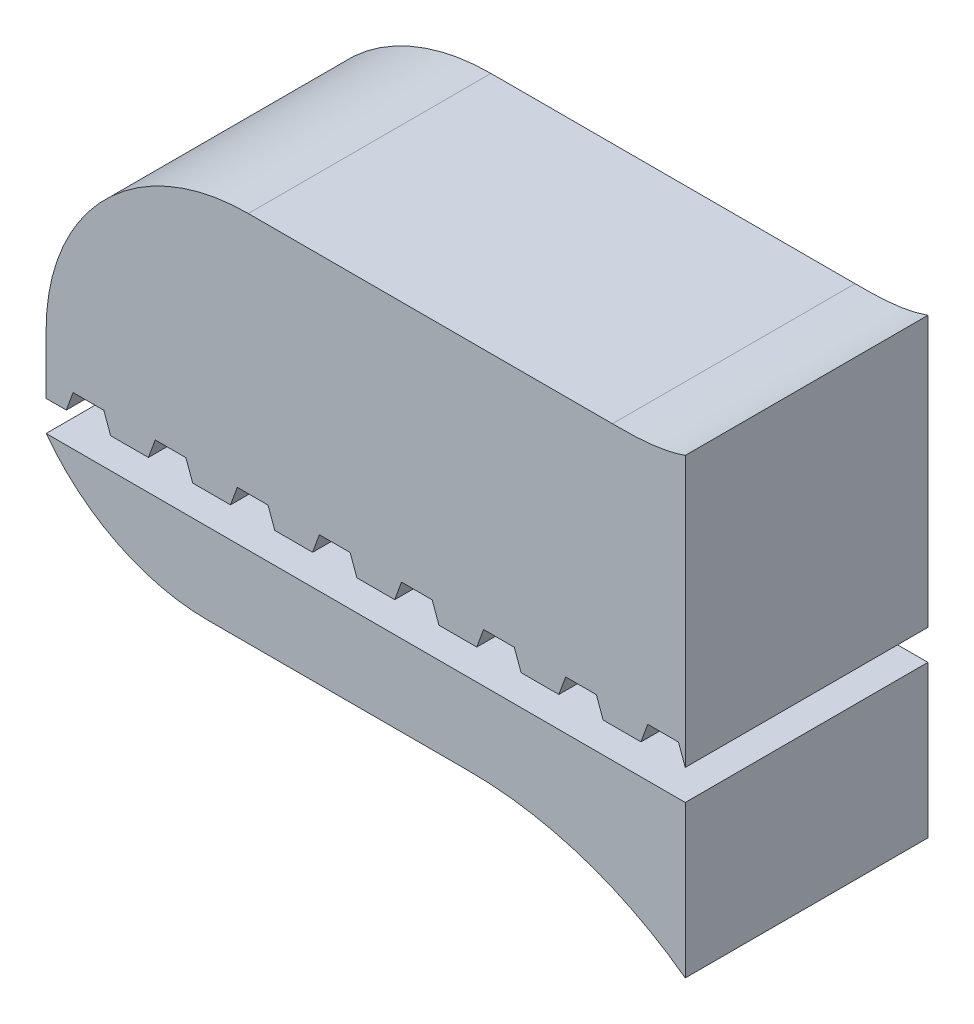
ISO-10303-21;
HEADER;
FILE_DESCRIPTION(('STEP AP214'),'2;1');
FILE_NAME('part.step','',(''),(''),'','','');
FILE_SCHEMA(('AUTOMOTIVE_DESIGN { 1 0 10303 214 1 1 1 1 }'));
ENDSEC;
DATA;
#1=APPLICATION_CONTEXT('core data for automotive mechanical design processes');
#2=APPLICATION_PROTOCOL_DEFINITION('international standard','automotive_design',2000,#1);
#3=PRODUCT_CONTEXT('',#1,'mechanical');
#4=PRODUCT('Part','Part','',(#3));
#5=PRODUCT_RELATED_PRODUCT_CATEGORY('part','',(#4));
#6=PRODUCT_DEFINITION_FORMATION('','',#4);
#7=PRODUCT_DEFINITION_CONTEXT('part definition',#1,'design');
#8=PRODUCT_DEFINITION('design','',#6,#7);
#9=PRODUCT_DEFINITION_SHAPE('','',#8);
#10=(LENGTH_UNIT() NAMED_UNIT(*) SI_UNIT(.MILLI.,.METRE.));
#11=(NAMED_UNIT(*) PLANE_ANGLE_UNIT() SI_UNIT($,.RADIAN.));
#12=(NAMED_UNIT(*) SI_UNIT($,.STERADIAN.) SOLID_ANGLE_UNIT());
#13=UNCERTAINTY_MEASURE_WITH_UNIT(LENGTH_MEASURE(1.E-05),#10,'distance_accuracy_value','');
#14=(GEOMETRIC_REPRESENTATION_CONTEXT(3) GLOBAL_UNCERTAINTY_ASSIGNED_CONTEXT((#13)) GLOBAL_UNIT_ASSIGNED_CONTEXT((#10,
#11,#12)) REPRESENTATION_CONTEXT('',''));
#15=CARTESIAN_POINT('',(0.,0.,0.));
#16=DIRECTION('',(0.,0.,1.));
#17=DIRECTION('',(1.,0.,0.));
#18=AXIS2_PLACEMENT_3D('',#15,#16,#17);
#19=CARTESIAN_POINT('',(-10.4933014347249,0.,0.));
#20=DIRECTION('',(-1.,0.,0.));
#21=DIRECTION('',(0.,0.,1.));
#22=AXIS2_PLACEMENT_3D('',#19,#20,#21);
#23=PLANE('',#22);
#24=DIRECTION('',(0.,-1.,0.));
#25=VECTOR('',#24,1.);
#26=CARTESIAN_POINT('',(-10.4933014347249,0.,0.));
#27=LINE('',#26,#25);
#28=CARTESIAN_POINT('',(-10.4933013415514,7.05742867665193,0.));
#29=VERTEX_POINT('',#28);
#30=CARTESIAN_POINT('',(-10.4933014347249,0.374999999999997,0.));
#31=VERTEX_POINT('',#30);
#32=EDGE_CURVE('E510',#29,#31,#27,.T.);
#33=ORIENTED_EDGE('',*,*,#32,.F.);
#34=CARTESIAN_POINT('',(-10.4933014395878,7.05734820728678,6.));
#35=CARTESIAN_POINT('',(-10.4933014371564,7.05734820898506,5.));
#36=CARTESIAN_POINT('',(-10.4933014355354,7.05734821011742,4.));
#37=CARTESIAN_POINT('',(-10.4933014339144,7.05734821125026,2.));
#38=CARTESIAN_POINT('',(-10.4933014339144,7.05734821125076,1.));
#39=CARTESIAN_POINT('',(-10.4933014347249,7.05734821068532,0.));
#40=B_SPLINE_CURVE_WITH_KNOTS('',3,(#34,#35,#36,#37,#38,#39),.UNSPECIFIED.,.F.,.F.,(4,2,4),(0.,
3.,6.),.UNSPECIFIED.);
#41=CARTESIAN_POINT('',(-10.4933013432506,7.0574288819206,6.));
#42=VERTEX_POINT('',#41);
#43=EDGE_CURVE('E556',#42,#29,#40,.T.);
#44=ORIENTED_EDGE('',*,*,#43,.F.);
#45=DIRECTION('',(0.,-1.,0.));
#46=VECTOR('',#45,1.);
#47=CARTESIAN_POINT('',(-10.4933014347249,0.,6.));
#48=LINE('',#47,#46);
#49=CARTESIAN_POINT('',(-10.4933014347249,0.374999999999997,6.));
#50=VERTEX_POINT('',#49);
#51=EDGE_CURVE('E555',#42,#50,#48,.T.);
#52=ORIENTED_EDGE('',*,*,#51,.T.);
#53=DIRECTION('',(0.,0.,-1.));
#54=VECTOR('',#53,1.);
#55=CARTESIAN_POINT('',(-10.4933014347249,0.374999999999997,6.));
#56=LINE('',#55,#54);
#57=EDGE_CURVE('E46',#50,#31,#56,.T.);
#58=ORIENTED_EDGE('',*,*,#57,.T.);
#59=EDGE_LOOP('',(#33,#44,#52,#58));
#60=FACE_BOUND('',#59,.T.);
#61=ADVANCED_FACE('F41',(#60),#23,.F.);
#62=CARTESIAN_POINT('',(0.,0.,6.));
#63=DIRECTION('',(0.,0.,1.));
#64=DIRECTION('',(1.,0.,0.));
#65=AXIS2_PLACEMENT_3D('',#62,#63,#64);
#66=PLANE('',#65);
#67=ORIENTED_EDGE('',*,*,#51,.F.);
#68=CARTESIAN_POINT('',(-12.2941856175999,6.83499999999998,6.));
#69=CARTESIAN_POINT('',(-11.9053138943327,6.83499999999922,6.));
#70=CARTESIAN_POINT('',(-11.5164421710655,6.83499999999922,6.));
#71=CARTESIAN_POINT('',(-10.6765507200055,6.9061724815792,6.));
#72=CARTESIAN_POINT('',(-9.88140351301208,7.2205133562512,6.));
#73=CARTESIAN_POINT('',(-9.16546346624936,7.85903476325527,6.));
#74=CARTESIAN_POINT('',(-8.9227206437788,8.12772633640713,6.));
#75=CARTESIAN_POINT('',(-8.69202165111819,8.36737620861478,6.));
#76=B_SPLINE_CURVE_WITH_KNOTS('',5,(#68,#69,#70,#71,#72,#73,#74,#75),.UNSPECIFIED.,.F.,.F.,(6,2,
6),(0.,0.5,1.),.UNSPECIFIED.);
#77=CARTESIAN_POINT('',(-12.2941856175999,6.83499999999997,6.));
#78=VERTEX_POINT('',#77);
#79=EDGE_CURVE('E527',#78,#42,#76,.T.);
#80=ORIENTED_EDGE('',*,*,#79,.F.);
#81=DIRECTION('',(-1.,0.,0.));
#82=VECTOR('',#81,1.);
#83=CARTESIAN_POINT('',(-26.2981540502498,6.83499999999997,6.));
#84=LINE('',#83,#82);
#85=CARTESIAN_POINT('',(-21.2981540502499,6.83499999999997,6.));
#86=VERTEX_POINT('',#85);
#87=EDGE_CURVE('E304',#78,#86,#84,.T.);
#88=ORIENTED_EDGE('',*,*,#87,.T.);
#89=CARTESIAN_POINT('',(-21.2981540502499,1.83499999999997,6.));
#90=DIRECTION('',(0.,0.,1.));
#91=DIRECTION('',(1.,0.,0.));
#92=AXIS2_PLACEMENT_3D('',#89,#90,#91);
#93=CIRCLE('',#92,5.);
#94=CARTESIAN_POINT('',(-26.2981540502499,1.83500000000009,6.));
#95=VERTEX_POINT('',#94);
#96=EDGE_CURVE('E522',#86,#95,#93,.T.);
#97=ORIENTED_EDGE('',*,*,#96,.T.);
#98=DIRECTION('',(0.,-1.,0.));
#99=VECTOR('',#98,1.);
#100=CARTESIAN_POINT('',(-26.2981540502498,6.83499999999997,6.));
#101=LINE('',#100,#99);
#102=CARTESIAN_POINT('',(-26.29815405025,0.375000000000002,6.));
#103=VERTEX_POINT('',#102);
#104=EDGE_CURVE('E167',#95,#103,#101,.T.);
#105=ORIENTED_EDGE('',*,*,#104,.T.);
#106=DIRECTION('',(1.,0.,0.));
#107=VECTOR('',#106,1.);
#108=CARTESIAN_POINT('',(-26.29815405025,0.375000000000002,6.));
#109=LINE('',#108,#107);
#110=CARTESIAN_POINT('',(-25.79815405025,0.375000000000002,6.));
#111=VERTEX_POINT('',#110);
#112=EDGE_CURVE('E162',#103,#111,#109,.T.);
#113=ORIENTED_EDGE('',*,*,#112,.T.);
#114=DIRECTION('',(0.342020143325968,0.939692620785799,0.));
#115=VECTOR('',#114,1.);
#116=CARTESIAN_POINT('',(-25.6307277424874,0.834999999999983,6.));
#117=LINE('',#116,#115);
#118=CARTESIAN_POINT('',(-25.6307277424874,0.834999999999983,6.));
#119=VERTEX_POINT('',#118);
#120=EDGE_CURVE('E485',#111,#119,#117,.T.);
#121=ORIENTED_EDGE('',*,*,#120,.T.);
#122=DIRECTION('',(1.,0.,0.));
#123=VECTOR('',#122,1.);
#124=CARTESIAN_POINT('',(-25.6307277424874,0.834999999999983,6.));
#125=LINE('',#124,#123);
#126=CARTESIAN_POINT('',(-24.8707277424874,0.834999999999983,6.));
#127=VERTEX_POINT('',#126);
#128=EDGE_CURVE('E284',#119,#127,#125,.T.);
#129=ORIENTED_EDGE('',*,*,#128,.T.);
#130=DIRECTION('',(0.342020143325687,-0.939692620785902,0.));
#131=VECTOR('',#130,1.);
#132=CARTESIAN_POINT('',(-24.8707277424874,0.834999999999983,6.));
#133=LINE('',#132,#131);
#134=CARTESIAN_POINT('',(-24.7033014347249,0.375000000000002,6.));
#135=VERTEX_POINT('',#134);
#136=EDGE_CURVE('E482',#127,#135,#133,.T.);
#137=ORIENTED_EDGE('',*,*,#136,.T.);
#138=DIRECTION('',(1.,0.,0.));
#139=VECTOR('',#138,1.);
#140=CARTESIAN_POINT('',(-24.7033014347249,0.375000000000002,6.));
#141=LINE('',#140,#139);
#142=CARTESIAN_POINT('',(-23.7681540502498,0.375000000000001,6.));
#143=VERTEX_POINT('',#142);
#144=EDGE_CURVE('E480',#135,#143,#141,.T.);
#145=ORIENTED_EDGE('',*,*,#144,.T.);
#146=DIRECTION('',(0.34202014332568,0.939692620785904,0.));
#147=VECTOR('',#146,1.);
#148=CARTESIAN_POINT('',(-23.6007277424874,0.834999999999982,6.));
#149=LINE('',#148,#147);
#150=CARTESIAN_POINT('',(-23.6007277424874,0.834999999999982,6.));
#151=VERTEX_POINT('',#150);
#152=EDGE_CURVE('E457',#143,#151,#149,.T.);
#153=ORIENTED_EDGE('',*,*,#152,.T.);
#154=DIRECTION('',(1.,0.,0.));
#155=VECTOR('',#154,1.);
#156=CARTESIAN_POINT('',(-23.6007277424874,0.834999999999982,6.));
#157=LINE('',#156,#155);
#158=CARTESIAN_POINT('',(-22.8407277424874,0.834999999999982,6.));
#159=VERTEX_POINT('',#158);
#160=EDGE_CURVE('E471',#151,#159,#157,.T.);
#161=ORIENTED_EDGE('',*,*,#160,.T.);
#162=DIRECTION('',(0.342020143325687,-0.939692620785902,0.));
#163=VECTOR('',#162,1.);
#164=CARTESIAN_POINT('',(-22.8407277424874,0.834999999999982,6.));
#165=LINE('',#164,#163);
#166=CARTESIAN_POINT('',(-22.6733014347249,0.375000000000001,6.));
#167=VERTEX_POINT('',#166);
#168=EDGE_CURVE('E469',#159,#167,#165,.T.);
#169=ORIENTED_EDGE('',*,*,#168,.T.);
#170=DIRECTION('',(1.,0.,0.));
#171=VECTOR('',#170,1.);
#172=CARTESIAN_POINT('',(-22.6733014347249,0.375000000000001,6.));
#173=LINE('',#172,#171);
#174=CARTESIAN_POINT('',(-21.7381540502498,0.375,6.));
#175=VERTEX_POINT('',#174);
#176=EDGE_CURVE('E472',#167,#175,#173,.T.);
#177=ORIENTED_EDGE('',*,*,#176,.T.);
#178=DIRECTION('',(0.34202014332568,0.939692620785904,0.));
#179=VECTOR('',#178,1.);
#180=CARTESIAN_POINT('',(-21.5707277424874,0.834999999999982,6.));
#181=LINE('',#180,#179);
#182=CARTESIAN_POINT('',(-21.5707277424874,0.834999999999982,6.));
#183=VERTEX_POINT('',#182);
#184=EDGE_CURVE('E475',#175,#183,#181,.T.);
#185=ORIENTED_EDGE('',*,*,#184,.T.);
#186=DIRECTION('',(1.,0.,0.));
#187=VECTOR('',#186,1.);
#188=CARTESIAN_POINT('',(-21.5707277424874,0.834999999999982,6.));
#189=LINE('',#188,#187);
#190=CARTESIAN_POINT('',(-20.8107277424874,0.834999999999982,6.));
#191=VERTEX_POINT('',#190);
#192=EDGE_CURVE('E667',#183,#191,#189,.T.);
#193=ORIENTED_EDGE('',*,*,#192,.T.);
#194=DIRECTION('',(0.34202014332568,-0.939692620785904,0.));
#195=VECTOR('',#194,1.);
#196=CARTESIAN_POINT('',(-20.8107277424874,0.834999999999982,6.));
#197=LINE('',#196,#195);
#198=CARTESIAN_POINT('',(-20.6433014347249,0.375,6.));
#199=VERTEX_POINT('',#198);
#200=EDGE_CURVE('E665',#191,#199,#197,.T.);
#201=ORIENTED_EDGE('',*,*,#200,.T.);
#202=DIRECTION('',(1.,0.,0.));
#203=VECTOR('',#202,1.);
#204=CARTESIAN_POINT('',(-20.6433014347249,0.375,6.));
#205=LINE('',#204,#203);
#206=CARTESIAN_POINT('',(-19.7081540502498,0.375,6.));
#207=VERTEX_POINT('',#206);
#208=EDGE_CURVE('E663',#199,#207,#205,.T.);
#209=ORIENTED_EDGE('',*,*,#208,.T.);
#210=DIRECTION('',(0.342020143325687,0.939692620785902,0.));
#211=VECTOR('',#210,1.);
#212=CARTESIAN_POINT('',(-19.5407277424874,0.834999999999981,6.));
#213=LINE('',#212,#211);
#214=CARTESIAN_POINT('',(-19.5407277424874,0.834999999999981,6.));
#215=VERTEX_POINT('',#214);
#216=EDGE_CURVE('E661',#207,#215,#213,.T.);
#217=ORIENTED_EDGE('',*,*,#216,.T.);
#218=DIRECTION('',(1.,0.,0.));
#219=VECTOR('',#218,1.);
#220=CARTESIAN_POINT('',(-19.5407277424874,0.834999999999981,6.));
#221=LINE('',#220,#219);
#222=CARTESIAN_POINT('',(-18.7807277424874,0.834999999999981,6.));
#223=VERTEX_POINT('',#222);
#224=EDGE_CURVE('E659',#215,#223,#221,.T.);
#225=ORIENTED_EDGE('',*,*,#224,.T.);
#226=DIRECTION('',(0.34202014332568,-0.939692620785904,0.));
#227=VECTOR('',#226,1.);
#228=CARTESIAN_POINT('',(-18.7807277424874,0.834999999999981,6.));
#229=LINE('',#228,#227);
#230=CARTESIAN_POINT('',(-18.6133014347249,0.375,6.));
#231=VERTEX_POINT('',#230);
#232=EDGE_CURVE('E657',#223,#231,#229,.T.);
#233=ORIENTED_EDGE('',*,*,#232,.T.);
#234=DIRECTION('',(1.,0.,0.));
#235=VECTOR('',#234,1.);
#236=CARTESIAN_POINT('',(-18.6133014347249,0.375,6.));
#237=LINE('',#236,#235);
#238=CARTESIAN_POINT('',(-17.6781540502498,0.374999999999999,6.));
#239=VERTEX_POINT('',#238);
#240=EDGE_CURVE('E655',#231,#239,#237,.T.);
#241=ORIENTED_EDGE('',*,*,#240,.T.);
#242=DIRECTION('',(0.342020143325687,0.939692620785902,0.));
#243=VECTOR('',#242,1.);
#244=CARTESIAN_POINT('',(-17.5107277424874,0.83499999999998,6.));
#245=LINE('',#244,#243);
#246=CARTESIAN_POINT('',(-17.5107277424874,0.83499999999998,6.));
#247=VERTEX_POINT('',#246);
#248=EDGE_CURVE('E653',#239,#247,#245,.T.);
#249=ORIENTED_EDGE('',*,*,#248,.T.);
#250=DIRECTION('',(1.,0.,0.));
#251=VECTOR('',#250,1.);
#252=CARTESIAN_POINT('',(-17.5107277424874,0.83499999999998,6.));
#253=LINE('',#252,#251);
#254=CARTESIAN_POINT('',(-16.7507277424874,0.83499999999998,6.));
#255=VERTEX_POINT('',#254);
#256=EDGE_CURVE('E651',#247,#255,#253,.T.);
#257=ORIENTED_EDGE('',*,*,#256,.T.);
#258=DIRECTION('',(0.342020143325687,-0.939692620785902,0.));
#259=VECTOR('',#258,1.);
#260=CARTESIAN_POINT('',(-16.7507277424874,0.83499999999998,6.));
#261=LINE('',#260,#259);
#262=CARTESIAN_POINT('',(-16.5833014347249,0.374999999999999,6.));
#263=VERTEX_POINT('',#262);
#264=EDGE_CURVE('E649',#255,#263,#261,.T.);
#265=ORIENTED_EDGE('',*,*,#264,.T.);
#266=DIRECTION('',(1.,0.,0.));
#267=VECTOR('',#266,1.);
#268=CARTESIAN_POINT('',(-16.5833014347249,0.374999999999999,6.));
#269=LINE('',#268,#267);
#270=CARTESIAN_POINT('',(-15.6481540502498,0.374999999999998,6.));
#271=VERTEX_POINT('',#270);
#272=EDGE_CURVE('E647',#263,#271,#269,.T.);
#273=ORIENTED_EDGE('',*,*,#272,.T.);
#274=DIRECTION('',(0.34202014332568,0.939692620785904,0.));
#275=VECTOR('',#274,1.);
#276=CARTESIAN_POINT('',(-15.4807277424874,0.834999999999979,6.));
#277=LINE('',#276,#275);
#278=CARTESIAN_POINT('',(-15.4807277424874,0.834999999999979,6.));
#279=VERTEX_POINT('',#278);
#280=EDGE_CURVE('E645',#271,#279,#277,.T.);
#281=ORIENTED_EDGE('',*,*,#280,.T.);
#282=DIRECTION('',(1.,0.,0.));
#283=VECTOR('',#282,1.);
#284=CARTESIAN_POINT('',(-15.4807277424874,0.834999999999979,6.));
#285=LINE('',#284,#283);
#286=CARTESIAN_POINT('',(-14.7207277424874,0.83499999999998,6.));
#287=VERTEX_POINT('',#286);
#288=EDGE_CURVE('E643',#279,#287,#285,.T.);
#289=ORIENTED_EDGE('',*,*,#288,.T.);
#290=DIRECTION('',(0.342020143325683,-0.939692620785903,0.));
#291=VECTOR('',#290,1.);
#292=CARTESIAN_POINT('',(-14.7207277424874,0.83499999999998,6.));
#293=LINE('',#292,#291);
#294=CARTESIAN_POINT('',(-14.5533014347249,0.374999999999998,6.));
#295=VERTEX_POINT('',#294);
#296=EDGE_CURVE('E641',#287,#295,#293,.T.);
#297=ORIENTED_EDGE('',*,*,#296,.T.);
#298=DIRECTION('',(1.,0.,0.));
#299=VECTOR('',#298,1.);
#300=CARTESIAN_POINT('',(-14.5533014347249,0.374999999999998,6.));
#301=LINE('',#300,#299);
#302=CARTESIAN_POINT('',(-13.6181540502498,0.374999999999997,6.));
#303=VERTEX_POINT('',#302);
#304=EDGE_CURVE('E639',#295,#303,#301,.T.);
#305=ORIENTED_EDGE('',*,*,#304,.T.);
#306=DIRECTION('',(0.342020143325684,0.939692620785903,0.));
#307=VECTOR('',#306,1.);
#308=CARTESIAN_POINT('',(-13.4507277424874,0.834999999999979,6.));
#309=LINE('',#308,#307);
#310=CARTESIAN_POINT('',(-13.4507277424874,0.834999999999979,6.));
#311=VERTEX_POINT('',#310);
#312=EDGE_CURVE('E637',#303,#311,#309,.T.);
#313=ORIENTED_EDGE('',*,*,#312,.T.);
#314=DIRECTION('',(1.,0.,0.));
#315=VECTOR('',#314,1.);
#316=CARTESIAN_POINT('',(-13.4507277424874,0.834999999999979,6.));
#317=LINE('',#316,#315);
#318=CARTESIAN_POINT('',(-12.6907277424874,0.834999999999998,6.));
#319=VERTEX_POINT('',#318);
#320=EDGE_CURVE('E635',#311,#319,#317,.T.);
#321=ORIENTED_EDGE('',*,*,#320,.T.);
#322=DIRECTION('',(0.342020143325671,-0.939692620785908,0.));
#323=VECTOR('',#322,1.);
#324=CARTESIAN_POINT('',(-12.6907277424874,0.834999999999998,6.));
#325=LINE('',#324,#323);
#326=CARTESIAN_POINT('',(-12.5233014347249,0.374999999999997,6.));
#327=VERTEX_POINT('',#326);
#328=EDGE_CURVE('E633',#319,#327,#325,.T.);
#329=ORIENTED_EDGE('',*,*,#328,.T.);
#330=DIRECTION('',(1.,0.,0.));
#331=VECTOR('',#330,1.);
#332=CARTESIAN_POINT('',(-12.5233014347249,0.374999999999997,6.));
#333=LINE('',#332,#331);
#334=CARTESIAN_POINT('',(-11.5881540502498,0.374999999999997,6.));
#335=VERTEX_POINT('',#334);
#336=EDGE_CURVE('E629',#327,#335,#333,.T.);
#337=ORIENTED_EDGE('',*,*,#336,.T.);
#338=DIRECTION('',(0.342020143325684,0.939692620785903,0.));
#339=VECTOR('',#338,1.);
#340=CARTESIAN_POINT('',(-11.4207277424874,0.834999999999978,6.));
#341=LINE('',#340,#339);
#342=CARTESIAN_POINT('',(-11.4207277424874,0.834999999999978,6.));
#343=VERTEX_POINT('',#342);
#344=EDGE_CURVE('E628',#335,#343,#341,.T.);
#345=ORIENTED_EDGE('',*,*,#344,.T.);
#346=DIRECTION('',(1.,0.,0.));
#347=VECTOR('',#346,1.);
#348=CARTESIAN_POINT('',(-11.4207277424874,0.834999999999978,6.));
#349=LINE('',#348,#347);
#350=CARTESIAN_POINT('',(-10.6607277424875,0.834999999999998,6.));
#351=VERTEX_POINT('',#350);
#352=EDGE_CURVE('E626',#343,#351,#349,.T.);
#353=ORIENTED_EDGE('',*,*,#352,.T.);
#354=DIRECTION('',(0.342020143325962,-0.939692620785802,0.));
#355=VECTOR('',#354,1.);
#356=CARTESIAN_POINT('',(-10.6607277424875,0.834999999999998,6.));
#357=LINE('',#356,#355);
#358=EDGE_CURVE('E300',#351,#50,#357,.T.);
#359=ORIENTED_EDGE('',*,*,#358,.T.);
#360=EDGE_LOOP('',(#67,#80,#88,#97,#105,#113,#121,#129,#137,#145,#153,#161,#169,#177,#185,#193,
#201,#209,#217,#225,#233,#241,#249,#257,#265,#273,#281,#289,#297,#305,#313,#321,#329,#337,#345,
#353,#359));
#361=FACE_BOUND('',#360,.T.);
#362=ADVANCED_FACE('F533',(#361),#66,.T.);
#363=CARTESIAN_POINT('',(0.,0.,0.));
#364=DIRECTION('',(0.,0.,1.));
#365=DIRECTION('',(1.,0.,0.));
#366=AXIS2_PLACEMENT_3D('',#363,#364,#365);
#367=PLANE('',#366);
#368=CARTESIAN_POINT('',(-8.69202165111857,8.36737620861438,0.));
#369=CARTESIAN_POINT('',(-8.92272064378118,8.12772633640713,0.));
#370=CARTESIAN_POINT('',(-9.16546346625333,7.85903476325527,0.));
#371=CARTESIAN_POINT('',(-9.88140351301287,7.22051335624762,0.));
#372=CARTESIAN_POINT('',(-10.6765507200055,6.90617248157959,0.));
#373=CARTESIAN_POINT('',(-11.5164421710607,6.83499999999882,0.));
#374=CARTESIAN_POINT('',(-11.9053138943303,6.83499999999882,0.));
#375=CARTESIAN_POINT('',(-12.2941856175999,6.83499999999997,0.));
#376=B_SPLINE_CURVE_WITH_KNOTS('',5,(#368,#369,#370,#371,#372,#373,#374,#375),.UNSPECIFIED.,.F.,
.F.,(6,2,6),(0.,0.5,1.),.UNSPECIFIED.);
#377=CARTESIAN_POINT('',(-12.2941856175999,6.83499999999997,0.));
#378=VERTEX_POINT('',#377);
#379=EDGE_CURVE('E509',#29,#378,#376,.T.);
#380=ORIENTED_EDGE('',*,*,#379,.F.);
#381=ORIENTED_EDGE('',*,*,#32,.T.);
#382=DIRECTION('',(0.342020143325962,-0.939692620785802,0.));
#383=VECTOR('',#382,1.);
#384=CARTESIAN_POINT('',(-10.6607277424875,0.834999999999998,0.));
#385=LINE('',#384,#383);
#386=CARTESIAN_POINT('',(-10.6607277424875,0.834999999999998,0.));
#387=VERTEX_POINT('',#386);
#388=EDGE_CURVE('E394',#387,#31,#385,.T.);
#389=ORIENTED_EDGE('',*,*,#388,.F.);
#390=DIRECTION('',(1.,0.,0.));
#391=VECTOR('',#390,1.);
#392=CARTESIAN_POINT('',(-11.4207277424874,0.834999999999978,0.));
#393=LINE('',#392,#391);
#394=CARTESIAN_POINT('',(-11.4207277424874,0.834999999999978,0.));
#395=VERTEX_POINT('',#394);
#396=EDGE_CURVE('E175',#395,#387,#393,.T.);
#397=ORIENTED_EDGE('',*,*,#396,.F.);
#398=DIRECTION('',(0.342020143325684,0.939692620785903,0.));
#399=VECTOR('',#398,1.);
#400=CARTESIAN_POINT('',(-11.4207277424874,0.834999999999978,0.));
#401=LINE('',#400,#399);
#402=CARTESIAN_POINT('',(-11.5881540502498,0.374999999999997,0.));
#403=VERTEX_POINT('',#402);
#404=EDGE_CURVE('E398',#403,#395,#401,.T.);
#405=ORIENTED_EDGE('',*,*,#404,.F.);
#406=DIRECTION('',(1.,0.,0.));
#407=VECTOR('',#406,1.);
#408=CARTESIAN_POINT('',(-12.5233014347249,0.374999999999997,0.));
#409=LINE('',#408,#407);
#410=CARTESIAN_POINT('',(-12.5233014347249,0.374999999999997,0.));
#411=VERTEX_POINT('',#410);
#412=EDGE_CURVE('E400',#411,#403,#409,.T.);
#413=ORIENTED_EDGE('',*,*,#412,.F.);
#414=DIRECTION('',(0.342020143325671,-0.939692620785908,0.));
#415=VECTOR('',#414,1.);
#416=CARTESIAN_POINT('',(-12.6907277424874,0.834999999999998,0.));
#417=LINE('',#416,#415);
#418=CARTESIAN_POINT('',(-12.6907277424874,0.834999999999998,0.));
#419=VERTEX_POINT('',#418);
#420=EDGE_CURVE('E402',#419,#411,#417,.T.);
#421=ORIENTED_EDGE('',*,*,#420,.F.);
#422=DIRECTION('',(1.,0.,0.));
#423=VECTOR('',#422,1.);
#424=CARTESIAN_POINT('',(-13.4507277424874,0.834999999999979,0.));
#425=LINE('',#424,#423);
#426=CARTESIAN_POINT('',(-13.4507277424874,0.834999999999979,0.));
#427=VERTEX_POINT('',#426);
#428=EDGE_CURVE('E404',#427,#419,#425,.T.);
#429=ORIENTED_EDGE('',*,*,#428,.F.);
#430=DIRECTION('',(0.342020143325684,0.939692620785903,0.));
#431=VECTOR('',#430,1.);
#432=CARTESIAN_POINT('',(-13.4507277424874,0.834999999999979,0.));
#433=LINE('',#432,#431);
#434=CARTESIAN_POINT('',(-13.6181540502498,0.374999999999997,0.));
#435=VERTEX_POINT('',#434);
#436=EDGE_CURVE('E406',#435,#427,#433,.T.);
#437=ORIENTED_EDGE('',*,*,#436,.F.);
#438=DIRECTION('',(1.,0.,0.));
#439=VECTOR('',#438,1.);
#440=CARTESIAN_POINT('',(-14.5533014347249,0.374999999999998,0.));
#441=LINE('',#440,#439);
#442=CARTESIAN_POINT('',(-14.5533014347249,0.374999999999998,0.));
#443=VERTEX_POINT('',#442);
#444=EDGE_CURVE('E408',#443,#435,#441,.T.);
#445=ORIENTED_EDGE('',*,*,#444,.F.);
#446=DIRECTION('',(0.342020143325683,-0.939692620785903,0.));
#447=VECTOR('',#446,1.);
#448=CARTESIAN_POINT('',(-14.7207277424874,0.83499999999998,0.));
#449=LINE('',#448,#447);
#450=CARTESIAN_POINT('',(-14.7207277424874,0.83499999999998,0.));
#451=VERTEX_POINT('',#450);
#452=EDGE_CURVE('E410',#451,#443,#449,.T.);
#453=ORIENTED_EDGE('',*,*,#452,.F.);
#454=DIRECTION('',(1.,0.,0.));
#455=VECTOR('',#454,1.);
#456=CARTESIAN_POINT('',(-15.4807277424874,0.834999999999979,0.));
#457=LINE('',#456,#455);
#458=CARTESIAN_POINT('',(-15.4807277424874,0.834999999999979,0.));
#459=VERTEX_POINT('',#458);
#460=EDGE_CURVE('E412',#459,#451,#457,.T.);
#461=ORIENTED_EDGE('',*,*,#460,.F.);
#462=DIRECTION('',(0.34202014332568,0.939692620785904,0.));
#463=VECTOR('',#462,1.);
#464=CARTESIAN_POINT('',(-15.4807277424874,0.834999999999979,0.));
#465=LINE('',#464,#463);
#466=CARTESIAN_POINT('',(-15.6481540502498,0.374999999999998,0.));
#467=VERTEX_POINT('',#466);
#468=EDGE_CURVE('E414',#467,#459,#465,.T.);
#469=ORIENTED_EDGE('',*,*,#468,.F.);
#470=DIRECTION('',(1.,0.,0.));
#471=VECTOR('',#470,1.);
#472=CARTESIAN_POINT('',(-16.5833014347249,0.374999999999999,0.));
#473=LINE('',#472,#471);
#474=CARTESIAN_POINT('',(-16.5833014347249,0.374999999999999,0.));
#475=VERTEX_POINT('',#474);
#476=EDGE_CURVE('E416',#475,#467,#473,.T.);
#477=ORIENTED_EDGE('',*,*,#476,.F.);
#478=DIRECTION('',(0.342020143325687,-0.939692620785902,0.));
#479=VECTOR('',#478,1.);
#480=CARTESIAN_POINT('',(-16.7507277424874,0.83499999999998,0.));
#481=LINE('',#480,#479);
#482=CARTESIAN_POINT('',(-16.7507277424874,0.83499999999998,0.));
#483=VERTEX_POINT('',#482);
#484=EDGE_CURVE('E418',#483,#475,#481,.T.);
#485=ORIENTED_EDGE('',*,*,#484,.F.);
#486=DIRECTION('',(1.,0.,0.));
#487=VECTOR('',#486,1.);
#488=CARTESIAN_POINT('',(-17.5107277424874,0.83499999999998,0.));
#489=LINE('',#488,#487);
#490=CARTESIAN_POINT('',(-17.5107277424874,0.83499999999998,0.));
#491=VERTEX_POINT('',#490);
#492=EDGE_CURVE('E420',#491,#483,#489,.T.);
#493=ORIENTED_EDGE('',*,*,#492,.F.);
#494=DIRECTION('',(0.342020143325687,0.939692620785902,0.));
#495=VECTOR('',#494,1.);
#496=CARTESIAN_POINT('',(-17.5107277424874,0.83499999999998,0.));
#497=LINE('',#496,#495);
#498=CARTESIAN_POINT('',(-17.6781540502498,0.374999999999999,0.));
#499=VERTEX_POINT('',#498);
#500=EDGE_CURVE('E422',#499,#491,#497,.T.);
#501=ORIENTED_EDGE('',*,*,#500,.F.);
#502=DIRECTION('',(1.,0.,0.));
#503=VECTOR('',#502,1.);
#504=CARTESIAN_POINT('',(-18.6133014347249,0.375,0.));
#505=LINE('',#504,#503);
#506=CARTESIAN_POINT('',(-18.6133014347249,0.375,0.));
#507=VERTEX_POINT('',#506);
#508=EDGE_CURVE('E424',#507,#499,#505,.T.);
#509=ORIENTED_EDGE('',*,*,#508,.F.);
#510=DIRECTION('',(0.34202014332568,-0.939692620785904,0.));
#511=VECTOR('',#510,1.);
#512=CARTESIAN_POINT('',(-18.7807277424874,0.834999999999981,0.));
#513=LINE('',#512,#511);
#514=CARTESIAN_POINT('',(-18.7807277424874,0.834999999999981,0.));
#515=VERTEX_POINT('',#514);
#516=EDGE_CURVE('E426',#515,#507,#513,.T.);
#517=ORIENTED_EDGE('',*,*,#516,.F.);
#518=DIRECTION('',(1.,0.,0.));
#519=VECTOR('',#518,1.);
#520=CARTESIAN_POINT('',(-19.5407277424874,0.834999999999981,0.));
#521=LINE('',#520,#519);
#522=CARTESIAN_POINT('',(-19.5407277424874,0.834999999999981,0.));
#523=VERTEX_POINT('',#522);
#524=EDGE_CURVE('E428',#523,#515,#521,.T.);
#525=ORIENTED_EDGE('',*,*,#524,.F.);
#526=DIRECTION('',(0.342020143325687,0.939692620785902,0.));
#527=VECTOR('',#526,1.);
#528=CARTESIAN_POINT('',(-19.5407277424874,0.834999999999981,0.));
#529=LINE('',#528,#527);
#530=CARTESIAN_POINT('',(-19.7081540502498,0.375,0.));
#531=VERTEX_POINT('',#530);
#532=EDGE_CURVE('E430',#531,#523,#529,.T.);
#533=ORIENTED_EDGE('',*,*,#532,.F.);
#534=DIRECTION('',(1.,0.,0.));
#535=VECTOR('',#534,1.);
#536=CARTESIAN_POINT('',(-20.6433014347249,0.375,0.));
#537=LINE('',#536,#535);
#538=CARTESIAN_POINT('',(-20.6433014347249,0.375,0.));
#539=VERTEX_POINT('',#538);
#540=EDGE_CURVE('E432',#539,#531,#537,.T.);
#541=ORIENTED_EDGE('',*,*,#540,.F.);
#542=DIRECTION('',(0.34202014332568,-0.939692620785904,0.));
#543=VECTOR('',#542,1.);
#544=CARTESIAN_POINT('',(-20.8107277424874,0.834999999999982,0.));
#545=LINE('',#544,#543);
#546=CARTESIAN_POINT('',(-20.8107277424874,0.834999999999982,0.));
#547=VERTEX_POINT('',#546);
#548=EDGE_CURVE('E434',#547,#539,#545,.T.);
#549=ORIENTED_EDGE('',*,*,#548,.F.);
#550=DIRECTION('',(1.,0.,0.));
#551=VECTOR('',#550,1.);
#552=CARTESIAN_POINT('',(-21.5707277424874,0.834999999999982,0.));
#553=LINE('',#552,#551);
#554=CARTESIAN_POINT('',(-21.5707277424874,0.834999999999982,0.));
#555=VERTEX_POINT('',#554);
#556=EDGE_CURVE('E436',#555,#547,#553,.T.);
#557=ORIENTED_EDGE('',*,*,#556,.F.);
#558=DIRECTION('',(0.34202014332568,0.939692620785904,0.));
#559=VECTOR('',#558,1.);
#560=CARTESIAN_POINT('',(-21.5707277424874,0.834999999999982,0.));
#561=LINE('',#560,#559);
#562=CARTESIAN_POINT('',(-21.7381540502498,0.375,0.));
#563=VERTEX_POINT('',#562);
#564=EDGE_CURVE('E438',#563,#555,#561,.T.);
#565=ORIENTED_EDGE('',*,*,#564,.F.);
#566=DIRECTION('',(1.,0.,0.));
#567=VECTOR('',#566,1.);
#568=CARTESIAN_POINT('',(-22.6733014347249,0.375000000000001,0.));
#569=LINE('',#568,#567);
#570=CARTESIAN_POINT('',(-22.6733014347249,0.375000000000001,0.));
#571=VERTEX_POINT('',#570);
#572=EDGE_CURVE('E440',#571,#563,#569,.T.);
#573=ORIENTED_EDGE('',*,*,#572,.F.);
#574=DIRECTION('',(0.342020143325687,-0.939692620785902,0.));
#575=VECTOR('',#574,1.);
#576=CARTESIAN_POINT('',(-22.8407277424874,0.834999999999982,0.));
#577=LINE('',#576,#575);
#578=CARTESIAN_POINT('',(-22.8407277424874,0.834999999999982,0.));
#579=VERTEX_POINT('',#578);
#580=EDGE_CURVE('E442',#579,#571,#577,.T.);
#581=ORIENTED_EDGE('',*,*,#580,.F.);
#582=DIRECTION('',(1.,0.,0.));
#583=VECTOR('',#582,1.);
#584=CARTESIAN_POINT('',(-23.6007277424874,0.834999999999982,0.));
#585=LINE('',#584,#583);
#586=CARTESIAN_POINT('',(-23.6007277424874,0.834999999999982,0.));
#587=VERTEX_POINT('',#586);
#588=EDGE_CURVE('E444',#587,#579,#585,.T.);
#589=ORIENTED_EDGE('',*,*,#588,.F.);
#590=DIRECTION('',(0.34202014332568,0.939692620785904,0.));
#591=VECTOR('',#590,1.);
#592=CARTESIAN_POINT('',(-23.6007277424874,0.834999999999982,0.));
#593=LINE('',#592,#591);
#594=CARTESIAN_POINT('',(-23.7681540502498,0.375000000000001,0.));
#595=VERTEX_POINT('',#594);
#596=EDGE_CURVE('E446',#595,#587,#593,.T.);
#597=ORIENTED_EDGE('',*,*,#596,.F.);
#598=DIRECTION('',(1.,0.,0.));
#599=VECTOR('',#598,1.);
#600=CARTESIAN_POINT('',(-24.7033014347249,0.375000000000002,0.));
#601=LINE('',#600,#599);
#602=CARTESIAN_POINT('',(-24.7033014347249,0.375000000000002,0.));
#603=VERTEX_POINT('',#602);
#604=EDGE_CURVE('E292',#603,#595,#601,.T.);
#605=ORIENTED_EDGE('',*,*,#604,.F.);
#606=DIRECTION('',(0.342020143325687,-0.939692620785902,0.));
#607=VECTOR('',#606,1.);
#608=CARTESIAN_POINT('',(-24.8707277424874,0.834999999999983,0.));
#609=LINE('',#608,#607);
#610=CARTESIAN_POINT('',(-24.8707277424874,0.834999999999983,0.));
#611=VERTEX_POINT('',#610);
#612=EDGE_CURVE('E290',#611,#603,#609,.T.);
#613=ORIENTED_EDGE('',*,*,#612,.F.);
#614=DIRECTION('',(1.,0.,0.));
#615=VECTOR('',#614,1.);
#616=CARTESIAN_POINT('',(-25.6307277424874,0.834999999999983,0.));
#617=LINE('',#616,#615);
#618=CARTESIAN_POINT('',(-25.6307277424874,0.834999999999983,0.));
#619=VERTEX_POINT('',#618);
#620=EDGE_CURVE('E278',#619,#611,#617,.T.);
#621=ORIENTED_EDGE('',*,*,#620,.F.);
#622=DIRECTION('',(0.342020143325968,0.939692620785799,0.));
#623=VECTOR('',#622,1.);
#624=CARTESIAN_POINT('',(-25.6307277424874,0.834999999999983,0.));
#625=LINE('',#624,#623);
#626=CARTESIAN_POINT('',(-25.79815405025,0.375000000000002,0.));
#627=VERTEX_POINT('',#626);
#628=EDGE_CURVE('E267',#627,#619,#625,.T.);
#629=ORIENTED_EDGE('',*,*,#628,.F.);
#630=DIRECTION('',(1.,0.,0.));
#631=VECTOR('',#630,1.);
#632=CARTESIAN_POINT('',(-26.29815405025,0.375000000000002,0.));
#633=LINE('',#632,#631);
#634=CARTESIAN_POINT('',(-26.29815405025,0.375000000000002,0.));
#635=VERTEX_POINT('',#634);
#636=EDGE_CURVE('E277',#635,#627,#633,.T.);
#637=ORIENTED_EDGE('',*,*,#636,.F.);
#638=DIRECTION('',(0.,-1.,0.));
#639=VECTOR('',#638,1.);
#640=CARTESIAN_POINT('',(-26.2981540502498,6.83499999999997,0.));
#641=LINE('',#640,#639);
#642=CARTESIAN_POINT('',(-26.2981540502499,1.83500000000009,0.));
#643=VERTEX_POINT('',#642);
#644=EDGE_CURVE('E52',#643,#635,#641,.T.);
#645=ORIENTED_EDGE('',*,*,#644,.F.);
#646=CARTESIAN_POINT('',(-21.2981540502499,1.83499999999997,0.));
#647=DIRECTION('',(0.,0.,1.));
#648=DIRECTION('',(1.,0.,0.));
#649=AXIS2_PLACEMENT_3D('',#646,#647,#648);
#650=CIRCLE('',#649,5.);
#651=CARTESIAN_POINT('',(-21.2981540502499,6.83499999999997,0.));
#652=VERTEX_POINT('',#651);
#653=EDGE_CURVE('E524',#643,#652,#650,.F.);
#654=ORIENTED_EDGE('',*,*,#653,.T.);
#655=DIRECTION('',(-1.,0.,0.));
#656=VECTOR('',#655,1.);
#657=CARTESIAN_POINT('',(-26.2981540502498,6.83499999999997,0.));
#658=LINE('',#657,#656);
#659=EDGE_CURVE('E13',#378,#652,#658,.T.);
#660=ORIENTED_EDGE('',*,*,#659,.F.);
#661=EDGE_LOOP('',(#380,#381,#389,#397,#405,#413,#421,#429,#437,#445,#453,#461,#469,#477,#485,
#493,#501,#509,#517,#525,#533,#541,#549,#557,#565,#573,#581,#589,#597,#605,#613,#621,#629,#637,
#645,#654,#660));
#662=FACE_BOUND('',#661,.T.);
#663=ADVANCED_FACE('F43',(#662),#367,.F.);
#664=CARTESIAN_POINT('',(-12.2941856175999,6.83499999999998,6.6));
#665=CARTESIAN_POINT('',(-12.2941856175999,6.83499999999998,4.2));
#666=CARTESIAN_POINT('',(-12.2941856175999,6.83499999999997,1.8));
#667=CARTESIAN_POINT('',(-12.2941856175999,6.83499999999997,-0.599999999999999));
#668=CARTESIAN_POINT('',(-11.9053138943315,6.83499999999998,6.6));
#669=CARTESIAN_POINT('',(-11.9053138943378,6.83499999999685,4.2));
#670=CARTESIAN_POINT('',(-11.9053138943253,6.83499999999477,1.8));
#671=CARTESIAN_POINT('',(-11.9053138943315,6.83499999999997,-0.599999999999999));
#672=CARTESIAN_POINT('',(-11.5164421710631,6.83499999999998,6.6));
#673=CARTESIAN_POINT('',(-11.5164421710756,6.83499999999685,4.20000000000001));
#674=CARTESIAN_POINT('',(-11.5164421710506,6.83499999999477,1.8));
#675=CARTESIAN_POINT('',(-11.5164421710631,6.83499999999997,-0.599999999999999));
#676=CARTESIAN_POINT('',(-10.6765507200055,6.90617248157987,6.6));
#677=CARTESIAN_POINT('',(-10.6765507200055,6.90617248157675,4.2));
#678=CARTESIAN_POINT('',(-10.6765507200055,6.90617248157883,1.8));
#679=CARTESIAN_POINT('',(-10.6765507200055,6.90617248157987,-0.599999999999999));
#680=CARTESIAN_POINT('',(-9.88140351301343,7.22051335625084,6.6));
#681=CARTESIAN_POINT('',(-9.88140351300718,7.22051335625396,4.2));
#682=CARTESIAN_POINT('',(-9.88140351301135,7.22051335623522,1.8));
#683=CARTESIAN_POINT('',(-9.88140351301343,7.22051335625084,-0.599999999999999));
#684=CARTESIAN_POINT('',(-9.16546346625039,7.85903476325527,6.6));
#685=CARTESIAN_POINT('',(-9.16546346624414,7.85903476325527,4.2));
#686=CARTESIAN_POINT('',(-9.16546346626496,7.85903476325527,1.8));
#687=CARTESIAN_POINT('',(-9.16546346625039,7.85903476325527,-0.599999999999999));
#688=CARTESIAN_POINT('',(-8.92272064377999,8.12772633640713,6.6));
#689=CARTESIAN_POINT('',(-8.92272064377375,8.12772633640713,4.2));
#690=CARTESIAN_POINT('',(-8.92272064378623,8.12772633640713,1.8));
#691=CARTESIAN_POINT('',(-8.92272064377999,8.12772633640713,-0.599999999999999));
#692=CARTESIAN_POINT('',(-8.69202165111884,8.3673762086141,6.6));
#693=CARTESIAN_POINT('',(-8.69202165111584,8.36737620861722,4.2));
#694=CARTESIAN_POINT('',(-8.69202165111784,8.36737620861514,1.8));
#695=CARTESIAN_POINT('',(-8.69202165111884,8.3673762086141,-0.599999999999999));
#696=B_SPLINE_SURFACE_WITH_KNOTS('',5,3,((#664,#665,#666,#667),(#668,#669,#670,#671),(#672,#673,
#674,#675),(#676,#677,#678,#679),(#680,#681,#682,#683),(#684,#685,#686,#687),(#688,#689,#690,
#691),(#692,#693,#694,#695)),.UNSPECIFIED.,.F.,.F.,.F.,(6,2,6),(4,4),(0.,0.5,1.),(-0.0006,
0.0066),.UNSPECIFIED.);
#697=CARTESIAN_POINT('',(-12.2941856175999,6.83499999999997,-0.599999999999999));
#698=CARTESIAN_POINT('',(-12.2941856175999,6.83499999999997,1.8));
#699=CARTESIAN_POINT('',(-12.2941856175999,6.83499999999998,4.2));
#700=CARTESIAN_POINT('',(-12.2941856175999,6.83499999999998,6.6));
#701=B_SPLINE_CURVE_WITH_KNOTS('',3,(#697,#698,#699,#700),.UNSPECIFIED.,.F.,.F.,(4,4),(-0.0006,
0.0066),.UNSPECIFIED.);
#702=EDGE_CURVE('E309',#78,#378,#701,.F.);
#703=ORIENTED_EDGE('',*,*,#79,.T.);
#704=ORIENTED_EDGE('',*,*,#43,.T.);
#705=ORIENTED_EDGE('',*,*,#379,.T.);
#706=ORIENTED_EDGE('',*,*,#702,.F.);
#707=EDGE_LOOP('',(#703,#704,#705,#706));
#708=FACE_BOUND('',#707,.T.);
#709=ADVANCED_FACE('F557',(#708),#696,.T.);
#710=CARTESIAN_POINT('',(-26.2981540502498,6.83499999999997,6.));
#711=DIRECTION('',(0.,-1.,0.));
#712=DIRECTION('',(1.,0.,0.));
#713=AXIS2_PLACEMENT_3D('',#710,#711,#712);
#714=PLANE('',#713);
#715=ORIENTED_EDGE('',*,*,#659,.T.);
#716=DIRECTION('',(0.,0.,-1.));
#717=VECTOR('',#716,1.);
#718=CARTESIAN_POINT('',(-21.2981540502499,6.83499999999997,6.));
#719=LINE('',#718,#717);
#720=EDGE_CURVE('E517',#652,#86,#719,.F.);
#721=ORIENTED_EDGE('',*,*,#720,.T.);
#722=ORIENTED_EDGE('',*,*,#87,.F.);
#723=ORIENTED_EDGE('',*,*,#702,.T.);
#724=EDGE_LOOP('',(#715,#721,#722,#723));
#725=FACE_BOUND('',#724,.T.);
#726=ADVANCED_FACE('F564',(#725),#714,.F.);
#727=CARTESIAN_POINT('',(-26.2981540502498,6.83499999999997,6.));
#728=DIRECTION('',(1.,0.,0.));
#729=DIRECTION('',(0.,1.,0.));
#730=AXIS2_PLACEMENT_3D('',#727,#728,#729);
#731=PLANE('',#730);
#732=ORIENTED_EDGE('',*,*,#104,.F.);
#733=DIRECTION('',(0.,0.,-1.));
#734=VECTOR('',#733,1.);
#735=CARTESIAN_POINT('',(-26.2981540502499,1.83500000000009,6.));
#736=LINE('',#735,#734);
#737=EDGE_CURVE('E520',#95,#643,#736,.T.);
#738=ORIENTED_EDGE('',*,*,#737,.T.);
#739=ORIENTED_EDGE('',*,*,#644,.T.);
#740=DIRECTION('',(0.,0.,-1.));
#741=VECTOR('',#740,1.);
#742=CARTESIAN_POINT('',(-26.29815405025,0.375000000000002,6.));
#743=LINE('',#742,#741);
#744=EDGE_CURVE('E307',#103,#635,#743,.T.);
#745=ORIENTED_EDGE('',*,*,#744,.F.);
#746=EDGE_LOOP('',(#732,#738,#739,#745));
#747=FACE_BOUND('',#746,.T.);
#748=ADVANCED_FACE('F610',(#747),#731,.F.);
#749=CARTESIAN_POINT('',(-26.29815405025,0.375000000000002,6.));
#750=DIRECTION('',(0.,1.,0.));
#751=DIRECTION('',(-1.,0.,0.));
#752=AXIS2_PLACEMENT_3D('',#749,#750,#751);
#753=PLANE('',#752);
#754=ORIENTED_EDGE('',*,*,#636,.T.);
#755=DIRECTION('',(0.,0.,-1.));
#756=VECTOR('',#755,1.);
#757=CARTESIAN_POINT('',(-25.79815405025,0.375000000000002,6.));
#758=LINE('',#757,#756);
#759=EDGE_CURVE('E273',#111,#627,#758,.T.);
#760=ORIENTED_EDGE('',*,*,#759,.F.);
#761=ORIENTED_EDGE('',*,*,#112,.F.);
#762=ORIENTED_EDGE('',*,*,#744,.T.);
#763=EDGE_LOOP('',(#754,#760,#761,#762));
#764=FACE_BOUND('',#763,.T.);
#765=ADVANCED_FACE('F1028',(#764),#753,.F.);
#766=CARTESIAN_POINT('',(-25.6307277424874,0.834999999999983,6.));
#767=DIRECTION('',(-0.939692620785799,0.342020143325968,0.));
#768=DIRECTION('',(-0.342020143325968,-0.939692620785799,0.));
#769=AXIS2_PLACEMENT_3D('',#766,#767,#768);
#770=PLANE('',#769);
#771=ORIENTED_EDGE('',*,*,#628,.T.);
#772=DIRECTION('',(0.,0.,-1.));
#773=VECTOR('',#772,1.);
#774=CARTESIAN_POINT('',(-25.6307277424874,0.834999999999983,6.));
#775=LINE('',#774,#773);
#776=EDGE_CURVE('E271',#119,#619,#775,.T.);
#777=ORIENTED_EDGE('',*,*,#776,.F.);
#778=ORIENTED_EDGE('',*,*,#120,.F.);
#779=ORIENTED_EDGE('',*,*,#759,.T.);
#780=EDGE_LOOP('',(#771,#777,#778,#779));
#781=FACE_BOUND('',#780,.T.);
#782=ADVANCED_FACE('F269',(#781),#770,.F.);
#783=CARTESIAN_POINT('',(-25.6307277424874,0.834999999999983,6.));
#784=DIRECTION('',(0.,1.,0.));
#785=DIRECTION('',(-1.,0.,0.));
#786=AXIS2_PLACEMENT_3D('',#783,#784,#785);
#787=PLANE('',#786);
#788=ORIENTED_EDGE('',*,*,#620,.T.);
#789=DIRECTION('',(0.,0.,-1.));
#790=VECTOR('',#789,1.);
#791=CARTESIAN_POINT('',(-24.8707277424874,0.834999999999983,6.));
#792=LINE('',#791,#790);
#793=EDGE_CURVE('E285',#127,#611,#792,.T.);
#794=ORIENTED_EDGE('',*,*,#793,.F.);
#795=ORIENTED_EDGE('',*,*,#128,.F.);
#796=ORIENTED_EDGE('',*,*,#776,.T.);
#797=EDGE_LOOP('',(#788,#794,#795,#796));
#798=FACE_BOUND('',#797,.T.);
#799=ADVANCED_FACE('F281',(#798),#787,.F.);
#800=CARTESIAN_POINT('',(-24.8707277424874,0.834999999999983,6.));
#801=DIRECTION('',(0.939692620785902,0.342020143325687,0.));
#802=DIRECTION('',(-0.342020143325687,0.939692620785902,0.));
#803=AXIS2_PLACEMENT_3D('',#800,#801,#802);
#804=PLANE('',#803);
#805=ORIENTED_EDGE('',*,*,#612,.T.);
#806=DIRECTION('',(0.,0.,-1.));
#807=VECTOR('',#806,1.);
#808=CARTESIAN_POINT('',(-24.7033014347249,0.375000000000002,6.));
#809=LINE('',#808,#807);
#810=EDGE_CURVE('E312',#135,#603,#809,.T.);
#811=ORIENTED_EDGE('',*,*,#810,.F.);
#812=ORIENTED_EDGE('',*,*,#136,.F.);
#813=ORIENTED_EDGE('',*,*,#793,.T.);
#814=EDGE_LOOP('',(#805,#811,#812,#813));
#815=FACE_BOUND('',#814,.T.);
#816=ADVANCED_FACE('F1002',(#815),#804,.F.);
#817=CARTESIAN_POINT('',(-24.7033014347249,0.375000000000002,6.));
#818=DIRECTION('',(0.,1.,0.));
#819=DIRECTION('',(-1.,0.,0.));
#820=AXIS2_PLACEMENT_3D('',#817,#818,#819);
#821=PLANE('',#820);
#822=ORIENTED_EDGE('',*,*,#604,.T.);
#823=DIRECTION('',(0.,0.,-1.));
#824=VECTOR('',#823,1.);
#825=CARTESIAN_POINT('',(-23.7681540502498,0.375000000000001,6.));
#826=LINE('',#825,#824);
#827=EDGE_CURVE('E315',#143,#595,#826,.T.);
#828=ORIENTED_EDGE('',*,*,#827,.F.);
#829=ORIENTED_EDGE('',*,*,#144,.F.);
#830=ORIENTED_EDGE('',*,*,#810,.T.);
#831=EDGE_LOOP('',(#822,#828,#829,#830));
#832=FACE_BOUND('',#831,.T.);
#833=ADVANCED_FACE('F449',(#832),#821,.F.);
#834=CARTESIAN_POINT('',(-23.6007277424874,0.834999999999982,6.));
#835=DIRECTION('',(-0.939692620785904,0.34202014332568,0.));
#836=DIRECTION('',(-0.34202014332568,-0.939692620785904,0.));
#837=AXIS2_PLACEMENT_3D('',#834,#835,#836);
#838=PLANE('',#837);
#839=ORIENTED_EDGE('',*,*,#596,.T.);
#840=DIRECTION('',(0.,0.,-1.));
#841=VECTOR('',#840,1.);
#842=CARTESIAN_POINT('',(-23.6007277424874,0.834999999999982,6.));
#843=LINE('',#842,#841);
#844=EDGE_CURVE('E318',#151,#587,#843,.T.);
#845=ORIENTED_EDGE('',*,*,#844,.F.);
#846=ORIENTED_EDGE('',*,*,#152,.F.);
#847=ORIENTED_EDGE('',*,*,#827,.T.);
#848=EDGE_LOOP('',(#839,#845,#846,#847));
#849=FACE_BOUND('',#848,.T.);
#850=ADVANCED_FACE('F455',(#849),#838,.F.);
#851=CARTESIAN_POINT('',(-23.6007277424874,0.834999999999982,6.));
#852=DIRECTION('',(0.,1.,0.));
#853=DIRECTION('',(-1.,0.,0.));
#854=AXIS2_PLACEMENT_3D('',#851,#852,#853);
#855=PLANE('',#854);
#856=ORIENTED_EDGE('',*,*,#588,.T.);
#857=DIRECTION('',(0.,0.,-1.));
#858=VECTOR('',#857,1.);
#859=CARTESIAN_POINT('',(-22.8407277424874,0.834999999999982,6.));
#860=LINE('',#859,#858);
#861=EDGE_CURVE('E321',#159,#579,#860,.T.);
#862=ORIENTED_EDGE('',*,*,#861,.F.);
#863=ORIENTED_EDGE('',*,*,#160,.F.);
#864=ORIENTED_EDGE('',*,*,#844,.T.);
#865=EDGE_LOOP('',(#856,#862,#863,#864));
#866=FACE_BOUND('',#865,.T.);
#867=ADVANCED_FACE('F463',(#866),#855,.F.);
#868=CARTESIAN_POINT('',(-22.8407277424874,0.834999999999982,6.));
#869=DIRECTION('',(0.939692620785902,0.342020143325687,0.));
#870=DIRECTION('',(-0.342020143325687,0.939692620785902,0.));
#871=AXIS2_PLACEMENT_3D('',#868,#869,#870);
#872=PLANE('',#871);
#873=ORIENTED_EDGE('',*,*,#580,.T.);
#874=DIRECTION('',(0.,0.,-1.));
#875=VECTOR('',#874,1.);
#876=CARTESIAN_POINT('',(-22.6733014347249,0.375000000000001,6.));
#877=LINE('',#876,#875);
#878=EDGE_CURVE('E324',#167,#571,#877,.T.);
#879=ORIENTED_EDGE('',*,*,#878,.F.);
#880=ORIENTED_EDGE('',*,*,#168,.F.);
#881=ORIENTED_EDGE('',*,*,#861,.T.);
#882=EDGE_LOOP('',(#873,#879,#880,#881));
#883=FACE_BOUND('',#882,.T.);
#884=ADVANCED_FACE('F467',(#883),#872,.F.);
#885=CARTESIAN_POINT('',(-22.6733014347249,0.375000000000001,6.));
#886=DIRECTION('',(0.,1.,0.));
#887=DIRECTION('',(-1.,0.,0.));
#888=AXIS2_PLACEMENT_3D('',#885,#886,#887);
#889=PLANE('',#888);
#890=ORIENTED_EDGE('',*,*,#572,.T.);
#891=DIRECTION('',(0.,0.,-1.));
#892=VECTOR('',#891,1.);
#893=CARTESIAN_POINT('',(-21.7381540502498,0.375,6.));
#894=LINE('',#893,#892);
#895=EDGE_CURVE('E327',#175,#563,#894,.T.);
#896=ORIENTED_EDGE('',*,*,#895,.F.);
#897=ORIENTED_EDGE('',*,*,#176,.F.);
#898=ORIENTED_EDGE('',*,*,#878,.T.);
#899=EDGE_LOOP('',(#890,#896,#897,#898));
#900=FACE_BOUND('',#899,.T.);
#901=ADVANCED_FACE('F774',(#900),#889,.F.);
#902=CARTESIAN_POINT('',(-21.5707277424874,0.834999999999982,6.));
#903=DIRECTION('',(-0.939692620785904,0.34202014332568,0.));
#904=DIRECTION('',(-0.34202014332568,-0.939692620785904,0.));
#905=AXIS2_PLACEMENT_3D('',#902,#903,#904);
#906=PLANE('',#905);
#907=ORIENTED_EDGE('',*,*,#564,.T.);
#908=DIRECTION('',(0.,0.,-1.));
#909=VECTOR('',#908,1.);
#910=CARTESIAN_POINT('',(-21.5707277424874,0.834999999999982,6.));
#911=LINE('',#910,#909);
#912=EDGE_CURVE('E330',#183,#555,#911,.T.);
#913=ORIENTED_EDGE('',*,*,#912,.F.);
#914=ORIENTED_EDGE('',*,*,#184,.F.);
#915=ORIENTED_EDGE('',*,*,#895,.T.);
#916=EDGE_LOOP('',(#907,#913,#914,#915));
#917=FACE_BOUND('',#916,.T.);
#918=ADVANCED_FACE('F674',(#917),#906,.F.);
#919=CARTESIAN_POINT('',(-21.5707277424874,0.834999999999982,6.));
#920=DIRECTION('',(0.,1.,0.));
#921=DIRECTION('',(-1.,0.,0.));
#922=AXIS2_PLACEMENT_3D('',#919,#920,#921);
#923=PLANE('',#922);
#924=ORIENTED_EDGE('',*,*,#556,.T.);
#925=DIRECTION('',(0.,0.,-1.));
#926=VECTOR('',#925,1.);
#927=CARTESIAN_POINT('',(-20.8107277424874,0.834999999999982,6.));
#928=LINE('',#927,#926);
#929=EDGE_CURVE('E333',#191,#547,#928,.T.);
#930=ORIENTED_EDGE('',*,*,#929,.F.);
#931=ORIENTED_EDGE('',*,*,#192,.F.);
#932=ORIENTED_EDGE('',*,*,#912,.T.);
#933=EDGE_LOOP('',(#924,#930,#931,#932));
#934=FACE_BOUND('',#933,.T.);
#935=ADVANCED_FACE('F678',(#934),#923,.F.);
#936=CARTESIAN_POINT('',(-20.8107277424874,0.834999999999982,6.));
#937=DIRECTION('',(0.939692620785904,0.34202014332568,0.));
#938=DIRECTION('',(-0.34202014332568,0.939692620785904,0.));
#939=AXIS2_PLACEMENT_3D('',#936,#937,#938);
#940=PLANE('',#939);
#941=ORIENTED_EDGE('',*,*,#548,.T.);
#942=DIRECTION('',(0.,0.,-1.));
#943=VECTOR('',#942,1.);
#944=CARTESIAN_POINT('',(-20.6433014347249,0.375,6.));
#945=LINE('',#944,#943);
#946=EDGE_CURVE('E336',#199,#539,#945,.T.);
#947=ORIENTED_EDGE('',*,*,#946,.F.);
#948=ORIENTED_EDGE('',*,*,#200,.F.);
#949=ORIENTED_EDGE('',*,*,#929,.T.);
#950=EDGE_LOOP('',(#941,#947,#948,#949));
#951=FACE_BOUND('',#950,.T.);
#952=ADVANCED_FACE('F683',(#951),#940,.F.);
#953=CARTESIAN_POINT('',(-20.6433014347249,0.375,6.));
#954=DIRECTION('',(0.,1.,0.));
#955=DIRECTION('',(-1.,0.,0.));
#956=AXIS2_PLACEMENT_3D('',#953,#954,#955);
#957=PLANE('',#956);
#958=ORIENTED_EDGE('',*,*,#540,.T.);
#959=DIRECTION('',(0.,0.,-1.));
#960=VECTOR('',#959,1.);
#961=CARTESIAN_POINT('',(-19.7081540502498,0.375,6.));
#962=LINE('',#961,#960);
#963=EDGE_CURVE('E339',#207,#531,#962,.T.);
#964=ORIENTED_EDGE('',*,*,#963,.F.);
#965=ORIENTED_EDGE('',*,*,#208,.F.);
#966=ORIENTED_EDGE('',*,*,#946,.T.);
#967=EDGE_LOOP('',(#958,#964,#965,#966));
#968=FACE_BOUND('',#967,.T.);
#969=ADVANCED_FACE('F689',(#968),#957,.F.);
#970=CARTESIAN_POINT('',(-19.5407277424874,0.834999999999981,6.));
#971=DIRECTION('',(-0.939692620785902,0.342020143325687,0.));
#972=DIRECTION('',(-0.342020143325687,-0.939692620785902,0.));
#973=AXIS2_PLACEMENT_3D('',#970,#971,#972);
#974=PLANE('',#973);
#975=ORIENTED_EDGE('',*,*,#532,.T.);
#976=DIRECTION('',(0.,0.,-1.));
#977=VECTOR('',#976,1.);
#978=CARTESIAN_POINT('',(-19.5407277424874,0.834999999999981,6.));
#979=LINE('',#978,#977);
#980=EDGE_CURVE('E342',#215,#523,#979,.T.);
#981=ORIENTED_EDGE('',*,*,#980,.F.);
#982=ORIENTED_EDGE('',*,*,#216,.F.);
#983=ORIENTED_EDGE('',*,*,#963,.T.);
#984=EDGE_LOOP('',(#975,#981,#982,#983));
#985=FACE_BOUND('',#984,.T.);
#986=ADVANCED_FACE('F693',(#985),#974,.F.);
#987=CARTESIAN_POINT('',(-19.5407277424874,0.834999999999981,6.));
#988=DIRECTION('',(0.,1.,0.));
#989=DIRECTION('',(-1.,0.,0.));
#990=AXIS2_PLACEMENT_3D('',#987,#988,#989);
#991=PLANE('',#990);
#992=ORIENTED_EDGE('',*,*,#524,.T.);
#993=DIRECTION('',(0.,0.,-1.));
#994=VECTOR('',#993,1.);
#995=CARTESIAN_POINT('',(-18.7807277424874,0.834999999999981,6.));
#996=LINE('',#995,#994);
#997=EDGE_CURVE('E345',#223,#515,#996,.T.);
#998=ORIENTED_EDGE('',*,*,#997,.F.);
#999=ORIENTED_EDGE('',*,*,#224,.F.);
#1000=ORIENTED_EDGE('',*,*,#980,.T.);
#1001=EDGE_LOOP('',(#992,#998,#999,#1000));
#1002=FACE_BOUND('',#1001,.T.);
#1003=ADVANCED_FACE('F698',(#1002),#991,.F.);
#1004=CARTESIAN_POINT('',(-18.7807277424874,0.834999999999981,6.));
#1005=DIRECTION('',(0.939692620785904,0.34202014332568,0.));
#1006=DIRECTION('',(-0.34202014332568,0.939692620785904,0.));
#1007=AXIS2_PLACEMENT_3D('',#1004,#1005,#1006);
#1008=PLANE('',#1007);
#1009=ORIENTED_EDGE('',*,*,#516,.T.);
#1010=DIRECTION('',(0.,0.,-1.));
#1011=VECTOR('',#1010,1.);
#1012=CARTESIAN_POINT('',(-18.6133014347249,0.375,6.));
#1013=LINE('',#1012,#1011);
#1014=EDGE_CURVE('E348',#231,#507,#1013,.T.);
#1015=ORIENTED_EDGE('',*,*,#1014,.F.);
#1016=ORIENTED_EDGE('',*,*,#232,.F.);
#1017=ORIENTED_EDGE('',*,*,#997,.T.);
#1018=EDGE_LOOP('',(#1009,#1015,#1016,#1017));
#1019=FACE_BOUND('',#1018,.T.);
#1020=ADVANCED_FACE('F704',(#1019),#1008,.F.);
#1021=CARTESIAN_POINT('',(-18.6133014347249,0.375,6.));
#1022=DIRECTION('',(0.,1.,0.));
#1023=DIRECTION('',(-1.,0.,0.));
#1024=AXIS2_PLACEMENT_3D('',#1021,#1022,#1023);
#1025=PLANE('',#1024);
#1026=ORIENTED_EDGE('',*,*,#508,.T.);
#1027=DIRECTION('',(0.,0.,-1.));
#1028=VECTOR('',#1027,1.);
#1029=CARTESIAN_POINT('',(-17.6781540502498,0.374999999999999,6.));
#1030=LINE('',#1029,#1028);
#1031=EDGE_CURVE('E351',#239,#499,#1030,.T.);
#1032=ORIENTED_EDGE('',*,*,#1031,.F.);
#1033=ORIENTED_EDGE('',*,*,#240,.F.);
#1034=ORIENTED_EDGE('',*,*,#1014,.T.);
#1035=EDGE_LOOP('',(#1026,#1032,#1033,#1034));
#1036=FACE_BOUND('',#1035,.T.);
#1037=ADVANCED_FACE('F708',(#1036),#1025,.F.);
#1038=CARTESIAN_POINT('',(-17.5107277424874,0.83499999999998,6.));
#1039=DIRECTION('',(-0.939692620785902,0.342020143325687,0.));
#1040=DIRECTION('',(-0.342020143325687,-0.939692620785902,0.));
#1041=AXIS2_PLACEMENT_3D('',#1038,#1039,#1040);
#1042=PLANE('',#1041);
#1043=ORIENTED_EDGE('',*,*,#500,.T.);
#1044=DIRECTION('',(0.,0.,-1.));
#1045=VECTOR('',#1044,1.);
#1046=CARTESIAN_POINT('',(-17.5107277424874,0.83499999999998,6.));
#1047=LINE('',#1046,#1045);
#1048=EDGE_CURVE('E354',#247,#491,#1047,.T.);
#1049=ORIENTED_EDGE('',*,*,#1048,.F.);
#1050=ORIENTED_EDGE('',*,*,#248,.F.);
#1051=ORIENTED_EDGE('',*,*,#1031,.T.);
#1052=EDGE_LOOP('',(#1043,#1049,#1050,#1051));
#1053=FACE_BOUND('',#1052,.T.);
#1054=ADVANCED_FACE('F713',(#1053),#1042,.F.);
#1055=CARTESIAN_POINT('',(-17.5107277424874,0.83499999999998,6.));
#1056=DIRECTION('',(0.,1.,0.));
#1057=DIRECTION('',(-1.,0.,0.));
#1058=AXIS2_PLACEMENT_3D('',#1055,#1056,#1057);
#1059=PLANE('',#1058);
#1060=ORIENTED_EDGE('',*,*,#492,.T.);
#1061=DIRECTION('',(0.,0.,-1.));
#1062=VECTOR('',#1061,1.);
#1063=CARTESIAN_POINT('',(-16.7507277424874,0.83499999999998,6.));
#1064=LINE('',#1063,#1062);
#1065=EDGE_CURVE('E357',#255,#483,#1064,.T.);
#1066=ORIENTED_EDGE('',*,*,#1065,.F.);
#1067=ORIENTED_EDGE('',*,*,#256,.F.);
#1068=ORIENTED_EDGE('',*,*,#1048,.T.);
#1069=EDGE_LOOP('',(#1060,#1066,#1067,#1068));
#1070=FACE_BOUND('',#1069,.T.);
#1071=ADVANCED_FACE('F719',(#1070),#1059,.F.);
#1072=CARTESIAN_POINT('',(-16.7507277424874,0.83499999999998,6.));
#1073=DIRECTION('',(0.939692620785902,0.342020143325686,0.));
#1074=DIRECTION('',(-0.342020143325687,0.939692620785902,0.));
#1075=AXIS2_PLACEMENT_3D('',#1072,#1073,#1074);
#1076=PLANE('',#1075);
#1077=ORIENTED_EDGE('',*,*,#484,.T.);
#1078=DIRECTION('',(0.,0.,-1.));
#1079=VECTOR('',#1078,1.);
#1080=CARTESIAN_POINT('',(-16.5833014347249,0.374999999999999,6.));
#1081=LINE('',#1080,#1079);
#1082=EDGE_CURVE('E360',#263,#475,#1081,.T.);
#1083=ORIENTED_EDGE('',*,*,#1082,.F.);
#1084=ORIENTED_EDGE('',*,*,#264,.F.);
#1085=ORIENTED_EDGE('',*,*,#1065,.T.);
#1086=EDGE_LOOP('',(#1077,#1083,#1084,#1085));
#1087=FACE_BOUND('',#1086,.T.);
#1088=ADVANCED_FACE('F723',(#1087),#1076,.F.);
#1089=CARTESIAN_POINT('',(-16.5833014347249,0.374999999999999,6.));
#1090=DIRECTION('',(0.,1.,0.));
#1091=DIRECTION('',(-1.,0.,0.));
#1092=AXIS2_PLACEMENT_3D('',#1089,#1090,#1091);
#1093=PLANE('',#1092);
#1094=ORIENTED_EDGE('',*,*,#476,.T.);
#1095=DIRECTION('',(0.,0.,-1.));
#1096=VECTOR('',#1095,1.);
#1097=CARTESIAN_POINT('',(-15.6481540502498,0.374999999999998,6.));
#1098=LINE('',#1097,#1096);
#1099=EDGE_CURVE('E363',#271,#467,#1098,.T.);
#1100=ORIENTED_EDGE('',*,*,#1099,.F.);
#1101=ORIENTED_EDGE('',*,*,#272,.F.);
#1102=ORIENTED_EDGE('',*,*,#1082,.T.);
#1103=EDGE_LOOP('',(#1094,#1100,#1101,#1102));
#1104=FACE_BOUND('',#1103,.T.);
#1105=ADVANCED_FACE('F728',(#1104),#1093,.F.);
#1106=CARTESIAN_POINT('',(-15.4807277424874,0.834999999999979,6.));
#1107=DIRECTION('',(-0.939692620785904,0.34202014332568,0.));
#1108=DIRECTION('',(-0.34202014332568,-0.939692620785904,0.));
#1109=AXIS2_PLACEMENT_3D('',#1106,#1107,#1108);
#1110=PLANE('',#1109);
#1111=ORIENTED_EDGE('',*,*,#468,.T.);
#1112=DIRECTION('',(0.,0.,-1.));
#1113=VECTOR('',#1112,1.);
#1114=CARTESIAN_POINT('',(-15.4807277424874,0.834999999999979,6.));
#1115=LINE('',#1114,#1113);
#1116=EDGE_CURVE('E366',#279,#459,#1115,.T.);
#1117=ORIENTED_EDGE('',*,*,#1116,.F.);
#1118=ORIENTED_EDGE('',*,*,#280,.F.);
#1119=ORIENTED_EDGE('',*,*,#1099,.T.);
#1120=EDGE_LOOP('',(#1111,#1117,#1118,#1119));
#1121=FACE_BOUND('',#1120,.T.);
#1122=ADVANCED_FACE('F734',(#1121),#1110,.F.);
#1123=CARTESIAN_POINT('',(-15.4807277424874,0.834999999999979,6.));
#1124=DIRECTION('',(0.,1.,0.));
#1125=DIRECTION('',(-1.,0.,0.));
#1126=AXIS2_PLACEMENT_3D('',#1123,#1124,#1125);
#1127=PLANE('',#1126);
#1128=ORIENTED_EDGE('',*,*,#460,.T.);
#1129=DIRECTION('',(0.,0.,-1.));
#1130=VECTOR('',#1129,1.);
#1131=CARTESIAN_POINT('',(-14.7207277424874,0.83499999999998,6.));
#1132=LINE('',#1131,#1130);
#1133=EDGE_CURVE('E369',#287,#451,#1132,.T.);
#1134=ORIENTED_EDGE('',*,*,#1133,.F.);
#1135=ORIENTED_EDGE('',*,*,#288,.F.);
#1136=ORIENTED_EDGE('',*,*,#1116,.T.);
#1137=EDGE_LOOP('',(#1128,#1134,#1135,#1136));
#1138=FACE_BOUND('',#1137,.T.);
#1139=ADVANCED_FACE('F738',(#1138),#1127,.F.);
#1140=CARTESIAN_POINT('',(-14.7207277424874,0.83499999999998,6.));
#1141=DIRECTION('',(0.939692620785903,0.342020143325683,0.));
#1142=DIRECTION('',(-0.342020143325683,0.939692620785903,0.));
#1143=AXIS2_PLACEMENT_3D('',#1140,#1141,#1142);
#1144=PLANE('',#1143);
#1145=ORIENTED_EDGE('',*,*,#452,.T.);
#1146=DIRECTION('',(0.,0.,-1.));
#1147=VECTOR('',#1146,1.);
#1148=CARTESIAN_POINT('',(-14.5533014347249,0.374999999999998,6.));
#1149=LINE('',#1148,#1147);
#1150=EDGE_CURVE('E372',#295,#443,#1149,.T.);
#1151=ORIENTED_EDGE('',*,*,#1150,.F.);
#1152=ORIENTED_EDGE('',*,*,#296,.F.);
#1153=ORIENTED_EDGE('',*,*,#1133,.T.);
#1154=EDGE_LOOP('',(#1145,#1151,#1152,#1153));
#1155=FACE_BOUND('',#1154,.T.);
#1156=ADVANCED_FACE('F743',(#1155),#1144,.F.);
#1157=CARTESIAN_POINT('',(-14.5533014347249,0.374999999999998,6.));
#1158=DIRECTION('',(0.,1.,0.));
#1159=DIRECTION('',(-1.,0.,0.));
#1160=AXIS2_PLACEMENT_3D('',#1157,#1158,#1159);
#1161=PLANE('',#1160);
#1162=ORIENTED_EDGE('',*,*,#444,.T.);
#1163=DIRECTION('',(0.,0.,-1.));
#1164=VECTOR('',#1163,1.);
#1165=CARTESIAN_POINT('',(-13.6181540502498,0.374999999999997,6.));
#1166=LINE('',#1165,#1164);
#1167=EDGE_CURVE('E375',#303,#435,#1166,.T.);
#1168=ORIENTED_EDGE('',*,*,#1167,.F.);
#1169=ORIENTED_EDGE('',*,*,#304,.F.);
#1170=ORIENTED_EDGE('',*,*,#1150,.T.);
#1171=EDGE_LOOP('',(#1162,#1168,#1169,#1170));
#1172=FACE_BOUND('',#1171,.T.);
#1173=ADVANCED_FACE('F749',(#1172),#1161,.F.);
#1174=CARTESIAN_POINT('',(-13.4507277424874,0.834999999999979,6.));
#1175=DIRECTION('',(-0.939692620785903,0.342020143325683,0.));
#1176=DIRECTION('',(-0.342020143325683,-0.939692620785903,0.));
#1177=AXIS2_PLACEMENT_3D('',#1174,#1175,#1176);
#1178=PLANE('',#1177);
#1179=ORIENTED_EDGE('',*,*,#436,.T.);
#1180=DIRECTION('',(0.,0.,-1.));
#1181=VECTOR('',#1180,1.);
#1182=CARTESIAN_POINT('',(-13.4507277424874,0.834999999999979,6.));
#1183=LINE('',#1182,#1181);
#1184=EDGE_CURVE('E378',#311,#427,#1183,.T.);
#1185=ORIENTED_EDGE('',*,*,#1184,.F.);
#1186=ORIENTED_EDGE('',*,*,#312,.F.);
#1187=ORIENTED_EDGE('',*,*,#1167,.T.);
#1188=EDGE_LOOP('',(#1179,#1185,#1186,#1187));
#1189=FACE_BOUND('',#1188,.T.);
#1190=ADVANCED_FACE('F753',(#1189),#1178,.F.);
#1191=CARTESIAN_POINT('',(-13.4507277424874,0.834999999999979,6.));
#1192=DIRECTION('',(0.,1.,0.));
#1193=DIRECTION('',(-1.,0.,0.));
#1194=AXIS2_PLACEMENT_3D('',#1191,#1192,#1193);
#1195=PLANE('',#1194);
#1196=ORIENTED_EDGE('',*,*,#428,.T.);
#1197=DIRECTION('',(0.,0.,-1.));
#1198=VECTOR('',#1197,1.);
#1199=CARTESIAN_POINT('',(-12.6907277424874,0.834999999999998,6.));
#1200=LINE('',#1199,#1198);
#1201=EDGE_CURVE('E381',#319,#419,#1200,.T.);
#1202=ORIENTED_EDGE('',*,*,#1201,.F.);
#1203=ORIENTED_EDGE('',*,*,#320,.F.);
#1204=ORIENTED_EDGE('',*,*,#1184,.T.);
#1205=EDGE_LOOP('',(#1196,#1202,#1203,#1204));
#1206=FACE_BOUND('',#1205,.T.);
#1207=ADVANCED_FACE('F758',(#1206),#1195,.F.);
#1208=CARTESIAN_POINT('',(-12.6907277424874,0.834999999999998,6.));
#1209=DIRECTION('',(0.939692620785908,0.342020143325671,0.));
#1210=DIRECTION('',(-0.342020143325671,0.939692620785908,0.));
#1211=AXIS2_PLACEMENT_3D('',#1208,#1209,#1210);
#1212=PLANE('',#1211);
#1213=ORIENTED_EDGE('',*,*,#420,.T.);
#1214=DIRECTION('',(0.,0.,-1.));
#1215=VECTOR('',#1214,1.);
#1216=CARTESIAN_POINT('',(-12.5233014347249,0.374999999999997,6.));
#1217=LINE('',#1216,#1215);
#1218=EDGE_CURVE('E384',#327,#411,#1217,.T.);
#1219=ORIENTED_EDGE('',*,*,#1218,.F.);
#1220=ORIENTED_EDGE('',*,*,#328,.F.);
#1221=ORIENTED_EDGE('',*,*,#1201,.T.);
#1222=EDGE_LOOP('',(#1213,#1219,#1220,#1221));
#1223=FACE_BOUND('',#1222,.T.);
#1224=ADVANCED_FACE('F764',(#1223),#1212,.F.);
#1225=CARTESIAN_POINT('',(-12.5233014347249,0.374999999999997,6.));
#1226=DIRECTION('',(0.,1.,0.));
#1227=DIRECTION('',(-1.,0.,0.));
#1228=AXIS2_PLACEMENT_3D('',#1225,#1226,#1227);
#1229=PLANE('',#1228);
#1230=ORIENTED_EDGE('',*,*,#412,.T.);
#1231=DIRECTION('',(0.,0.,-1.));
#1232=VECTOR('',#1231,1.);
#1233=CARTESIAN_POINT('',(-11.5881540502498,0.374999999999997,6.));
#1234=LINE('',#1233,#1232);
#1235=EDGE_CURVE('E387',#335,#403,#1234,.T.);
#1236=ORIENTED_EDGE('',*,*,#1235,.F.);
#1237=ORIENTED_EDGE('',*,*,#336,.F.);
#1238=ORIENTED_EDGE('',*,*,#1218,.T.);
#1239=EDGE_LOOP('',(#1230,#1236,#1237,#1238));
#1240=FACE_BOUND('',#1239,.T.);
#1241=ADVANCED_FACE('F768',(#1240),#1229,.F.);
#1242=CARTESIAN_POINT('',(-11.4207277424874,0.834999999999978,6.));
#1243=DIRECTION('',(-0.939692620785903,0.342020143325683,0.));
#1244=DIRECTION('',(-0.342020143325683,-0.939692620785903,0.));
#1245=AXIS2_PLACEMENT_3D('',#1242,#1243,#1244);
#1246=PLANE('',#1245);
#1247=ORIENTED_EDGE('',*,*,#404,.T.);
#1248=DIRECTION('',(0.,0.,-1.));
#1249=VECTOR('',#1248,1.);
#1250=CARTESIAN_POINT('',(-11.4207277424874,0.834999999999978,6.));
#1251=LINE('',#1250,#1249);
#1252=EDGE_CURVE('E390',#343,#395,#1251,.T.);
#1253=ORIENTED_EDGE('',*,*,#1252,.F.);
#1254=ORIENTED_EDGE('',*,*,#344,.F.);
#1255=ORIENTED_EDGE('',*,*,#1235,.T.);
#1256=EDGE_LOOP('',(#1247,#1253,#1254,#1255));
#1257=FACE_BOUND('',#1256,.T.);
#1258=ADVANCED_FACE('F772',(#1257),#1246,.F.);
#1259=CARTESIAN_POINT('',(-11.4207277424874,0.834999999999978,6.));
#1260=DIRECTION('',(0.,1.,0.));
#1261=DIRECTION('',(-1.,0.,0.));
#1262=AXIS2_PLACEMENT_3D('',#1259,#1260,#1261);
#1263=PLANE('',#1262);
#1264=ORIENTED_EDGE('',*,*,#396,.T.);
#1265=DIRECTION('',(0.,0.,-1.));
#1266=VECTOR('',#1265,1.);
#1267=CARTESIAN_POINT('',(-10.6607277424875,0.834999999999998,6.));
#1268=LINE('',#1267,#1266);
#1269=EDGE_CURVE('E392',#351,#387,#1268,.T.);
#1270=ORIENTED_EDGE('',*,*,#1269,.F.);
#1271=ORIENTED_EDGE('',*,*,#352,.F.);
#1272=ORIENTED_EDGE('',*,*,#1252,.T.);
#1273=EDGE_LOOP('',(#1264,#1270,#1271,#1272));
#1274=FACE_BOUND('',#1273,.T.);
#1275=ADVANCED_FACE('F625',(#1274),#1263,.F.);
#1276=CARTESIAN_POINT('',(-10.6607277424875,0.834999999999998,6.));
#1277=DIRECTION('',(0.939692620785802,0.342020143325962,0.));
#1278=DIRECTION('',(-0.342020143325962,0.939692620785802,0.));
#1279=AXIS2_PLACEMENT_3D('',#1276,#1277,#1278);
#1280=PLANE('',#1279);
#1281=ORIENTED_EDGE('',*,*,#388,.T.);
#1282=ORIENTED_EDGE('',*,*,#57,.F.);
#1283=ORIENTED_EDGE('',*,*,#358,.F.);
#1284=ORIENTED_EDGE('',*,*,#1269,.T.);
#1285=EDGE_LOOP('',(#1281,#1282,#1283,#1284));
#1286=FACE_BOUND('',#1285,.T.);
#1287=ADVANCED_FACE('F547',(#1286),#1280,.F.);
#1288=CARTESIAN_POINT('',(-21.2981540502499,1.83499999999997,6.));
#1289=DIRECTION('',(0.,0.,-1.));
#1290=DIRECTION('',(-1.,0.,0.));
#1291=AXIS2_PLACEMENT_3D('',#1288,#1289,#1290);
#1292=CYLINDRICAL_SURFACE('',#1291,5.);
#1293=ORIENTED_EDGE('',*,*,#96,.F.);
#1294=ORIENTED_EDGE('',*,*,#720,.F.);
#1295=ORIENTED_EDGE('',*,*,#653,.F.);
#1296=ORIENTED_EDGE('',*,*,#737,.F.);
#1297=EDGE_LOOP('',(#1293,#1294,#1295,#1296));
#1298=FACE_BOUND('',#1297,.T.);
#1299=ADVANCED_FACE('F546',(#1298),#1292,.T.);
#1300=CLOSED_SHELL('',(#61,#362,#663,#709,#726,#748,#765,#782,#799,#816,#833,#850,#867,#884,
#901,#918,#935,#952,#969,#986,#1003,#1020,#1037,#1054,#1071,#1088,#1105,#1122,#1139,#1156,#1173,
#1190,#1207,#1224,#1241,#1258,#1275,#1287,#1299));
#1301=MANIFOLD_SOLID_BREP('B2',#1300);
#1302=CARTESIAN_POINT('',(-10.4933014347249,0.,0.));
#1303=DIRECTION('',(-1.,0.,0.));
#1304=DIRECTION('',(0.,0.,1.));
#1305=AXIS2_PLACEMENT_3D('',#1302,#1303,#1304);
#1306=PLANE('',#1305);
#1307=DIRECTION('',(0.,-1.,0.));
#1308=VECTOR('',#1307,1.);
#1309=CARTESIAN_POINT('',(-10.4933014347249,0.,6.));
#1310=LINE('',#1309,#1308);
#1311=CARTESIAN_POINT('',(-10.4933014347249,-0.374999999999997,6.));
#1312=VERTEX_POINT('',#1311);
#1313=CARTESIAN_POINT('',(-10.4933014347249,-4.13425307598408,6.));
#1314=VERTEX_POINT('',#1313);
#1315=EDGE_CURVE('E39',#1312,#1314,#1310,.T.);
#1316=ORIENTED_EDGE('',*,*,#1315,.T.);
#1317=DIRECTION('',(0.,0.,-1.));
#1318=VECTOR('',#1317,1.);
#1319=CARTESIAN_POINT('',(-10.4933014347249,-4.13425307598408,6.));
#1320=LINE('',#1319,#1318);
#1321=CARTESIAN_POINT('',(-10.4933014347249,-4.13425307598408,0.));
#1322=VERTEX_POINT('',#1321);
#1323=EDGE_CURVE('E1121',#1322,#1314,#1320,.F.);
#1324=ORIENTED_EDGE('',*,*,#1323,.F.);
#1325=DIRECTION('',(0.,-1.,0.));
#1326=VECTOR('',#1325,1.);
#1327=CARTESIAN_POINT('',(-10.4933014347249,0.,0.));
#1328=LINE('',#1327,#1326);
#1329=CARTESIAN_POINT('',(-10.4933014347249,-0.374999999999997,0.));
#1330=VERTEX_POINT('',#1329);
#1331=EDGE_CURVE('E1108',#1330,#1322,#1328,.T.);
#1332=ORIENTED_EDGE('',*,*,#1331,.F.);
#1333=DIRECTION('',(0.,0.,-1.));
#1334=VECTOR('',#1333,1.);
#1335=CARTESIAN_POINT('',(-10.4933014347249,-0.374999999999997,6.));
#1336=LINE('',#1335,#1334);
#1337=EDGE_CURVE('E1145',#1312,#1330,#1336,.T.);
#1338=ORIENTED_EDGE('',*,*,#1337,.F.);
#1339=EDGE_LOOP('',(#1316,#1324,#1332,#1338));
#1340=FACE_BOUND('',#1339,.T.);
#1341=ADVANCED_FACE('F1101',(#1340),#1306,.F.);
#1342=CARTESIAN_POINT('',(-22.2981540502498,2.625,6.));
#1343=DIRECTION('',(0.,0.,-1.));
#1344=DIRECTION('',(-1.,0.,0.));
#1345=AXIS2_PLACEMENT_3D('',#1342,#1343,#1344);
#1346=CYLINDRICAL_SURFACE('',#1345,5.);
#1347=CARTESIAN_POINT('',(-22.2981540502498,2.625,6.));
#1348=DIRECTION('',(0.,0.,1.));
#1349=DIRECTION('',(1.,0.,0.));
#1350=AXIS2_PLACEMENT_3D('',#1347,#1348,#1349);
#1351=CIRCLE('',#1350,5.);
#1352=CARTESIAN_POINT('',(-26.2981540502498,-0.375000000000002,6.));
#1353=VERTEX_POINT('',#1352);
#1354=CARTESIAN_POINT('',(-22.2981540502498,-2.375,6.));
#1355=VERTEX_POINT('',#1354);
#1356=EDGE_CURVE('E1182',#1353,#1355,#1351,.T.);
#1357=ORIENTED_EDGE('',*,*,#1356,.F.);
#1358=DIRECTION('',(0.,0.,-1.));
#1359=VECTOR('',#1358,1.);
#1360=CARTESIAN_POINT('',(-26.2981540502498,-0.375000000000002,6.));
#1361=LINE('',#1360,#1359);
#1362=CARTESIAN_POINT('',(-26.2981540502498,-0.375000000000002,0.));
#1363=VERTEX_POINT('',#1362);
#1364=EDGE_CURVE('E1152',#1353,#1363,#1361,.T.);
#1365=ORIENTED_EDGE('',*,*,#1364,.T.);
#1366=CARTESIAN_POINT('',(-22.2981540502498,2.625,0.));
#1367=DIRECTION('',(0.,0.,1.));
#1368=DIRECTION('',(1.,0.,0.));
#1369=AXIS2_PLACEMENT_3D('',#1366,#1367,#1368);
#1370=CIRCLE('',#1369,5.);
#1371=CARTESIAN_POINT('',(-22.2981540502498,-2.375,0.));
#1372=VERTEX_POINT('',#1371);
#1373=EDGE_CURVE('E1180',#1372,#1363,#1370,.F.);
#1374=ORIENTED_EDGE('',*,*,#1373,.F.);
#1375=DIRECTION('',(0.,0.,-1.));
#1376=VECTOR('',#1375,1.);
#1377=CARTESIAN_POINT('',(-22.2981540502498,-2.375,6.));
#1378=LINE('',#1377,#1376);
#1379=EDGE_CURVE('E1177',#1355,#1372,#1378,.T.);
#1380=ORIENTED_EDGE('',*,*,#1379,.F.);
#1381=EDGE_LOOP('',(#1357,#1365,#1374,#1380));
#1382=FACE_BOUND('',#1381,.T.);
#1383=ADVANCED_FACE('F1191',(#1382),#1346,.T.);
#1384=CARTESIAN_POINT('',(-26.2981540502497,-2.375,6.));
#1385=DIRECTION('',(0.,1.,0.));
#1386=DIRECTION('',(0.,0.,1.));
#1387=AXIS2_PLACEMENT_3D('',#1384,#1385,#1386);
#1388=PLANE('',#1387);
#1389=DIRECTION('',(1.,0.,0.));
#1390=VECTOR('',#1389,1.);
#1391=CARTESIAN_POINT('',(-26.2981540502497,-2.375,6.));
#1392=LINE('',#1391,#1390);
#1393=CARTESIAN_POINT('',(-15.8385408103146,-2.375,6.));
#1394=VERTEX_POINT('',#1393);
#1395=EDGE_CURVE('E1162',#1355,#1394,#1392,.T.);
#1396=ORIENTED_EDGE('',*,*,#1395,.F.);
#1397=ORIENTED_EDGE('',*,*,#1379,.T.);
#1398=DIRECTION('',(1.,0.,0.));
#1399=VECTOR('',#1398,1.);
#1400=CARTESIAN_POINT('',(-26.2981540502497,-2.375,0.));
#1401=LINE('',#1400,#1399);
#1402=CARTESIAN_POINT('',(-15.8385408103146,-2.375,0.));
#1403=VERTEX_POINT('',#1402);
#1404=EDGE_CURVE('E1163',#1372,#1403,#1401,.T.);
#1405=ORIENTED_EDGE('',*,*,#1404,.T.);
#1406=DIRECTION('',(0.,0.,1.));
#1407=VECTOR('',#1406,1.);
#1408=CARTESIAN_POINT('',(-15.8385408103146,-2.375,6.));
#1409=LINE('',#1408,#1407);
#1410=EDGE_CURVE('E1151',#1403,#1394,#1409,.T.);
#1411=ORIENTED_EDGE('',*,*,#1410,.T.);
#1412=EDGE_LOOP('',(#1396,#1397,#1405,#1411));
#1413=FACE_BOUND('',#1412,.T.);
#1414=ADVANCED_FACE('F1188',(#1413),#1388,.F.);
#1415=CARTESIAN_POINT('',(0.,0.,6.));
#1416=DIRECTION('',(0.,0.,1.));
#1417=DIRECTION('',(1.,0.,0.));
#1418=AXIS2_PLACEMENT_3D('',#1415,#1416,#1417);
#1419=PLANE('',#1418);
#1420=ORIENTED_EDGE('',*,*,#1315,.F.);
#1421=DIRECTION('',(-1.,0.,0.));
#1422=VECTOR('',#1421,1.);
#1423=CARTESIAN_POINT('',(-10.4933014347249,-0.374999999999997,6.));
#1424=LINE('',#1423,#1422);
#1425=EDGE_CURVE('E1156',#1312,#1353,#1424,.T.);
#1426=ORIENTED_EDGE('',*,*,#1425,.T.);
#1427=ORIENTED_EDGE('',*,*,#1356,.T.);
#1428=ORIENTED_EDGE('',*,*,#1395,.T.);
#1429=CARTESIAN_POINT('',(-15.8385408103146,-11.375,6.));
#1430=DIRECTION('',(0.,0.,1.));
#1431=DIRECTION('',(1.,0.,0.));
#1432=AXIS2_PLACEMENT_3D('',#1429,#1430,#1431);
#1433=CIRCLE('',#1432,9.);
#1434=EDGE_CURVE('E1158',#1394,#1314,#1433,.F.);
#1435=ORIENTED_EDGE('',*,*,#1434,.T.);
#1436=EDGE_LOOP('',(#1420,#1426,#1427,#1428,#1435));
#1437=FACE_BOUND('',#1436,.T.);
#1438=ADVANCED_FACE('F1155',(#1437),#1419,.T.);
#1439=CARTESIAN_POINT('',(0.,0.,0.));
#1440=DIRECTION('',(0.,0.,1.));
#1441=DIRECTION('',(1.,0.,0.));
#1442=AXIS2_PLACEMENT_3D('',#1439,#1440,#1441);
#1443=PLANE('',#1442);
#1444=DIRECTION('',(-1.,0.,0.));
#1445=VECTOR('',#1444,1.);
#1446=CARTESIAN_POINT('',(-10.4933014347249,-0.374999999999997,0.));
#1447=LINE('',#1446,#1445);
#1448=EDGE_CURVE('E1167',#1330,#1363,#1447,.T.);
#1449=ORIENTED_EDGE('',*,*,#1448,.F.);
#1450=ORIENTED_EDGE('',*,*,#1331,.T.);
#1451=CARTESIAN_POINT('',(-15.8385408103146,-11.375,0.));
#1452=DIRECTION('',(0.,0.,1.));
#1453=DIRECTION('',(1.,0.,0.));
#1454=AXIS2_PLACEMENT_3D('',#1451,#1452,#1453);
#1455=CIRCLE('',#1454,9.);
#1456=EDGE_CURVE('E1174',#1322,#1403,#1455,.T.);
#1457=ORIENTED_EDGE('',*,*,#1456,.T.);
#1458=ORIENTED_EDGE('',*,*,#1404,.F.);
#1459=ORIENTED_EDGE('',*,*,#1373,.T.);
#1460=EDGE_LOOP('',(#1449,#1450,#1457,#1458,#1459));
#1461=FACE_BOUND('',#1460,.T.);
#1462=ADVANCED_FACE('F1192',(#1461),#1443,.F.);
#1463=CARTESIAN_POINT('',(-15.8385408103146,-11.375,6.));
#1464=DIRECTION('',(0.,0.,-1.));
#1465=DIRECTION('',(-1.,0.,0.));
#1466=AXIS2_PLACEMENT_3D('',#1463,#1464,#1465);
#1467=CYLINDRICAL_SURFACE('',#1466,9.);
#1468=ORIENTED_EDGE('',*,*,#1456,.F.);
#1469=ORIENTED_EDGE('',*,*,#1323,.T.);
#1470=ORIENTED_EDGE('',*,*,#1434,.F.);
#1471=ORIENTED_EDGE('',*,*,#1410,.F.);
#1472=EDGE_LOOP('',(#1468,#1469,#1470,#1471));
#1473=FACE_BOUND('',#1472,.T.);
#1474=ADVANCED_FACE('F1193',(#1473),#1467,.F.);
#1475=CARTESIAN_POINT('',(-10.4933014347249,-0.374999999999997,6.));
#1476=DIRECTION('',(0.,-1.,0.));
#1477=DIRECTION('',(1.,0.,0.));
#1478=AXIS2_PLACEMENT_3D('',#1475,#1476,#1477);
#1479=PLANE('',#1478);
#1480=ORIENTED_EDGE('',*,*,#1448,.T.);
#1481=ORIENTED_EDGE('',*,*,#1364,.F.);
#1482=ORIENTED_EDGE('',*,*,#1425,.F.);
#1483=ORIENTED_EDGE('',*,*,#1337,.T.);
#1484=EDGE_LOOP('',(#1480,#1481,#1482,#1483));
#1485=FACE_BOUND('',#1484,.T.);
#1486=ADVANCED_FACE('F1159',(#1485),#1479,.F.);
#1487=CLOSED_SHELL('',(#1341,#1383,#1414,#1438,#1462,#1474,#1486));
#1488=MANIFOLD_SOLID_BREP('B7',#1487);
#1489=ADVANCED_BREP_SHAPE_REPRESENTATION('',(#18,#1301,#1488),#14);
#1490=SHAPE_DEFINITION_REPRESENTATION(#9,#1489);
ENDSEC;
END-ISO-10303-21;
